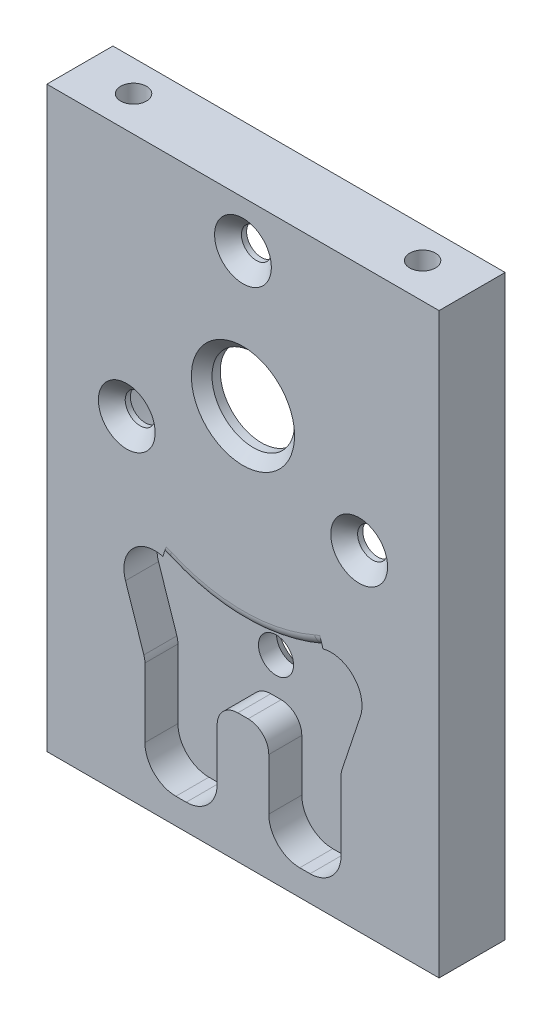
ISO-10303-21;
HEADER;
FILE_DESCRIPTION(('STEP AP214'),'2;1');
FILE_NAME('part.step','',(''),(''),'','','');
FILE_SCHEMA(('AUTOMOTIVE_DESIGN { 1 0 10303 214 1 1 1 1 }'));
ENDSEC;
DATA;
#1=APPLICATION_CONTEXT('core data for automotive mechanical design processes');
#2=APPLICATION_PROTOCOL_DEFINITION('international standard','automotive_design',2000,#1);
#3=PRODUCT_CONTEXT('',#1,'mechanical');
#4=PRODUCT('Part','Part','',(#3));
#5=PRODUCT_RELATED_PRODUCT_CATEGORY('part','',(#4));
#6=PRODUCT_DEFINITION_FORMATION('','',#4);
#7=PRODUCT_DEFINITION_CONTEXT('part definition',#1,'design');
#8=PRODUCT_DEFINITION('design','',#6,#7);
#9=PRODUCT_DEFINITION_SHAPE('','',#8);
#10=(LENGTH_UNIT() NAMED_UNIT(*) SI_UNIT(.MILLI.,.METRE.));
#11=(NAMED_UNIT(*) PLANE_ANGLE_UNIT() SI_UNIT($,.RADIAN.));
#12=(NAMED_UNIT(*) SI_UNIT($,.STERADIAN.) SOLID_ANGLE_UNIT());
#13=UNCERTAINTY_MEASURE_WITH_UNIT(LENGTH_MEASURE(1.E-05),#10,'distance_accuracy_value','');
#14=(GEOMETRIC_REPRESENTATION_CONTEXT(3) GLOBAL_UNCERTAINTY_ASSIGNED_CONTEXT((#13)) GLOBAL_UNIT_ASSIGNED_CONTEXT((#10,
#11,#12)) REPRESENTATION_CONTEXT('',''));
#15=CARTESIAN_POINT('',(0.,0.,0.));
#16=DIRECTION('',(0.,0.,1.));
#17=DIRECTION('',(1.,0.,0.));
#18=AXIS2_PLACEMENT_3D('',#15,#16,#17);
#19=CARTESIAN_POINT('',(0.,38.5,4.6));
#20=DIRECTION('',(0.,0.,-1.));
#21=DIRECTION('',(-1.,0.,0.));
#22=AXIS2_PLACEMENT_3D('',#19,#20,#21);
#23=PLANE('',#22);
#24=CARTESIAN_POINT('',(0.,51.5,4.6));
#25=DIRECTION('',(0.,0.,-1.));
#26=DIRECTION('',(-1.,0.,0.));
#27=AXIS2_PLACEMENT_3D('',#24,#25,#26);
#28=CIRCLE('',#27,1.44999999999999);
#29=CARTESIAN_POINT('',(-1.44999999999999,51.5,4.6));
#30=VERTEX_POINT('',#29);
#31=EDGE_CURVE('E683',#30,#30,#28,.F.);
#32=ORIENTED_EDGE('',*,*,#31,.T.);
#33=EDGE_LOOP('',(#32));
#34=FACE_BOUND('',#33,.T.);
#35=CARTESIAN_POINT('',(11.2583302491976,31.9999999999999,4.6));
#36=DIRECTION('',(0.,0.,-1.));
#37=DIRECTION('',(-1.,0.,0.));
#38=AXIS2_PLACEMENT_3D('',#35,#36,#37);
#39=CIRCLE('',#38,1.44999999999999);
#40=CARTESIAN_POINT('',(9.80833024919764,31.9999999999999,4.6));
#41=VERTEX_POINT('',#40);
#42=EDGE_CURVE('E676',#41,#41,#39,.F.);
#43=ORIENTED_EDGE('',*,*,#42,.T.);
#44=EDGE_LOOP('',(#43));
#45=FACE_BOUND('',#44,.T.);
#46=CARTESIAN_POINT('',(0.,38.5,4.6));
#47=DIRECTION('',(0.,0.,-1.));
#48=DIRECTION('',(-1.,0.,0.));
#49=AXIS2_PLACEMENT_3D('',#46,#47,#48);
#50=CIRCLE('',#49,16.54);
#51=CARTESIAN_POINT('',(-16.54,38.5,4.6));
#52=VERTEX_POINT('',#51);
#53=EDGE_CURVE('E435',#52,#52,#50,.T.);
#54=ORIENTED_EDGE('',*,*,#53,.T.);
#55=EDGE_LOOP('',(#54));
#56=FACE_BOUND('',#55,.T.);
#57=CARTESIAN_POINT('',(0.,38.5,4.6));
#58=DIRECTION('',(0.,0.,-1.));
#59=DIRECTION('',(-1.,0.,0.));
#60=AXIS2_PLACEMENT_3D('',#57,#58,#59);
#61=CIRCLE('',#60,4.00000000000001);
#62=CARTESIAN_POINT('',(-4.00000000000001,38.5,4.6));
#63=VERTEX_POINT('',#62);
#64=EDGE_CURVE('E632',#63,#63,#61,.T.);
#65=ORIENTED_EDGE('',*,*,#64,.F.);
#66=EDGE_LOOP('',(#65));
#67=FACE_BOUND('',#66,.T.);
#68=CARTESIAN_POINT('',(-11.2583302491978,32.,4.6));
#69=DIRECTION('',(0.,0.,-1.));
#70=DIRECTION('',(-1.,0.,0.));
#71=AXIS2_PLACEMENT_3D('',#68,#69,#70);
#72=CIRCLE('',#71,1.44999999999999);
#73=CARTESIAN_POINT('',(-12.7083302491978,32.,4.6));
#74=VERTEX_POINT('',#73);
#75=EDGE_CURVE('E669',#74,#74,#72,.F.);
#76=ORIENTED_EDGE('',*,*,#75,.T.);
#77=EDGE_LOOP('',(#76));
#78=FACE_BOUND('',#77,.T.);
#79=ADVANCED_FACE('F37',(#34,#45,#56,#67,#78),#23,.T.);
#80=CARTESIAN_POINT('',(19.,56.,6.4));
#81=DIRECTION('',(0.,0.,1.));
#82=DIRECTION('',(1.,0.,0.));
#83=AXIS2_PLACEMENT_3D('',#80,#81,#82);
#84=PLANE('',#83);
#85=CARTESIAN_POINT('',(8.53571975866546,19.0939922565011,6.39999999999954));
#86=DIRECTION('',(0.,0.,-1.));
#87=DIRECTION('',(-1.,0.,0.));
#88=AXIS2_PLACEMENT_3D('',#85,#86,#87);
#89=CIRCLE('',#88,4.);
#90=CARTESIAN_POINT('',(7.43981714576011,22.9409387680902,6.39999999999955));
#91=VERTEX_POINT('',#90);
#92=CARTESIAN_POINT('',(6.9252274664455,22.7554557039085,6.39999999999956));
#93=VERTEX_POINT('',#92);
#94=EDGE_CURVE('E258',#91,#93,#89,.F.);
#95=ORIENTED_EDGE('',*,*,#94,.F.);
#96=CARTESIAN_POINT('',(1.74068404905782E-13,20.,6.4));
#97=DIRECTION('',(0.,0.,1.));
#98=DIRECTION('',(1.,0.,0.));
#99=AXIS2_PLACEMENT_3D('',#96,#97,#98);
#100=CIRCLE('',#99,7.9999999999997);
#101=CARTESIAN_POINT('',(7.74881159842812,21.9889491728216,6.39999999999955));
#102=VERTEX_POINT('',#101);
#103=EDGE_CURVE('E11',#102,#91,#100,.T.);
#104=ORIENTED_EDGE('',*,*,#103,.F.);
#105=CARTESIAN_POINT('',(8.53571975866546,19.0939922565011,6.39999999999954));
#106=DIRECTION('',(0.,0.,-1.));
#107=DIRECTION('',(-1.,0.,0.));
#108=AXIS2_PLACEMENT_3D('',#105,#106,#107);
#109=CIRCLE('',#108,3.);
#110=CARTESIAN_POINT('',(11.381769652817,18.1453089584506,6.39999999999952));
#111=VERTEX_POINT('',#110);
#112=EDGE_CURVE('E244',#102,#111,#109,.T.);
#113=ORIENTED_EDGE('',*,*,#112,.T.);
#114=DIRECTION('',(-0.316227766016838,-0.948683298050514,0.));
#115=VECTOR('',#114,1.);
#116=CARTESIAN_POINT('',(11.381769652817,18.1453089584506,6.39999999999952));
#117=LINE('',#116,#115);
#118=CARTESIAN_POINT('',(9.60263340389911,12.8079002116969,6.39999999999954));
#119=VERTEX_POINT('',#118);
#120=EDGE_CURVE('E252',#111,#119,#117,.T.);
#121=ORIENTED_EDGE('',*,*,#120,.T.);
#122=CARTESIAN_POINT('',(11.5000000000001,12.1754446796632,6.39999999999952));
#123=DIRECTION('',(0.,0.,1.));
#124=DIRECTION('',(1.,0.,0.));
#125=AXIS2_PLACEMENT_3D('',#122,#123,#124);
#126=CIRCLE('',#125,2.);
#127=CARTESIAN_POINT('',(9.50000000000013,12.1754446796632,6.39999999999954));
#128=VERTEX_POINT('',#127);
#129=EDGE_CURVE('E483',#119,#128,#126,.T.);
#130=ORIENTED_EDGE('',*,*,#129,.T.);
#131=DIRECTION('',(0.,-1.,0.));
#132=VECTOR('',#131,1.);
#133=CARTESIAN_POINT('',(9.50000000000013,12.1754446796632,6.39999999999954));
#134=LINE('',#133,#132);
#135=CARTESIAN_POINT('',(9.50000000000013,5.49999999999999,6.39999999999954));
#136=VERTEX_POINT('',#135);
#137=EDGE_CURVE('E486',#128,#136,#134,.T.);
#138=ORIENTED_EDGE('',*,*,#137,.T.);
#139=CARTESIAN_POINT('',(6.50000000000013,5.49999999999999,6.39999999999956));
#140=DIRECTION('',(0.,0.,-1.));
#141=DIRECTION('',(1.,0.,0.));
#142=AXIS2_PLACEMENT_3D('',#139,#140,#141);
#143=CIRCLE('',#142,3.);
#144=CARTESIAN_POINT('',(6.50000000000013,2.49999999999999,6.39999999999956));
#145=VERTEX_POINT('',#144);
#146=EDGE_CURVE('E489',#136,#145,#143,.T.);
#147=ORIENTED_EDGE('',*,*,#146,.T.);
#148=DIRECTION('',(-1.,0.,0.));
#149=VECTOR('',#148,1.);
#150=CARTESIAN_POINT('',(5.50000000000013,2.49999999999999,6.39999999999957));
#151=LINE('',#150,#149);
#152=CARTESIAN_POINT('',(5.50000000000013,2.49999999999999,6.39999999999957));
#153=VERTEX_POINT('',#152);
#154=EDGE_CURVE('E492',#145,#153,#151,.T.);
#155=ORIENTED_EDGE('',*,*,#154,.T.);
#156=CARTESIAN_POINT('',(5.50000000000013,5.49999999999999,6.39999999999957));
#157=DIRECTION('',(0.,0.,-1.));
#158=DIRECTION('',(1.,0.,0.));
#159=AXIS2_PLACEMENT_3D('',#156,#157,#158);
#160=CIRCLE('',#159,3.);
#161=CARTESIAN_POINT('',(2.50000000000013,5.49999999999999,6.39999999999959));
#162=VERTEX_POINT('',#161);
#163=EDGE_CURVE('E495',#153,#162,#160,.T.);
#164=ORIENTED_EDGE('',*,*,#163,.T.);
#165=DIRECTION('',(0.,1.,0.));
#166=VECTOR('',#165,1.);
#167=CARTESIAN_POINT('',(2.50000000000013,10.5,6.39999999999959));
#168=LINE('',#167,#166);
#169=CARTESIAN_POINT('',(2.50000000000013,10.5,6.39999999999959));
#170=VERTEX_POINT('',#169);
#171=EDGE_CURVE('E498',#162,#170,#168,.T.);
#172=ORIENTED_EDGE('',*,*,#171,.T.);
#173=CARTESIAN_POINT('',(0.500000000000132,10.5,6.3999999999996));
#174=DIRECTION('',(0.,0.,1.));
#175=DIRECTION('',(-1.,0.,0.));
#176=AXIS2_PLACEMENT_3D('',#173,#174,#175);
#177=CIRCLE('',#176,2.);
#178=CARTESIAN_POINT('',(0.500000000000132,12.5,6.3999999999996));
#179=VERTEX_POINT('',#178);
#180=EDGE_CURVE('E501',#170,#179,#177,.T.);
#181=ORIENTED_EDGE('',*,*,#180,.T.);
#182=DIRECTION('',(-1.,0.,0.));
#183=VECTOR('',#182,1.);
#184=CARTESIAN_POINT('',(-0.499999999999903,12.5,6.39999999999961));
#185=LINE('',#184,#183);
#186=CARTESIAN_POINT('',(-0.499999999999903,12.5,6.39999999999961));
#187=VERTEX_POINT('',#186);
#188=EDGE_CURVE('E503',#179,#187,#185,.T.);
#189=ORIENTED_EDGE('',*,*,#188,.T.);
#190=CARTESIAN_POINT('',(-0.499999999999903,10.5,6.39999999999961));
#191=DIRECTION('',(0.,0.,1.));
#192=DIRECTION('',(1.,0.,0.));
#193=AXIS2_PLACEMENT_3D('',#190,#191,#192);
#194=CIRCLE('',#193,2.);
#195=CARTESIAN_POINT('',(-2.4999999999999,10.5,6.39999999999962));
#196=VERTEX_POINT('',#195);
#197=EDGE_CURVE('E506',#187,#196,#194,.T.);
#198=ORIENTED_EDGE('',*,*,#197,.T.);
#199=DIRECTION('',(0.,-1.,0.));
#200=VECTOR('',#199,1.);
#201=CARTESIAN_POINT('',(-2.4999999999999,10.5,6.39999999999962));
#202=LINE('',#201,#200);
#203=CARTESIAN_POINT('',(-2.4999999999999,5.49999999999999,6.39999999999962));
#204=VERTEX_POINT('',#203);
#205=EDGE_CURVE('E508',#196,#204,#202,.T.);
#206=ORIENTED_EDGE('',*,*,#205,.T.);
#207=CARTESIAN_POINT('',(-5.49999999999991,5.49999999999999,6.39999999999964));
#208=DIRECTION('',(0.,0.,-1.));
#209=DIRECTION('',(1.,0.,0.));
#210=AXIS2_PLACEMENT_3D('',#207,#208,#209);
#211=CIRCLE('',#210,3.);
#212=CARTESIAN_POINT('',(-5.49999999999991,2.49999999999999,6.39999999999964));
#213=VERTEX_POINT('',#212);
#214=EDGE_CURVE('E511',#204,#213,#211,.T.);
#215=ORIENTED_EDGE('',*,*,#214,.T.);
#216=DIRECTION('',(-1.,0.,0.));
#217=VECTOR('',#216,1.);
#218=CARTESIAN_POINT('',(-6.4999999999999,2.49999999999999,6.39999999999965));
#219=LINE('',#218,#217);
#220=CARTESIAN_POINT('',(-6.4999999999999,2.49999999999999,6.39999999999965));
#221=VERTEX_POINT('',#220);
#222=EDGE_CURVE('E514',#213,#221,#219,.T.);
#223=ORIENTED_EDGE('',*,*,#222,.T.);
#224=CARTESIAN_POINT('',(-6.4999999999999,5.49999999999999,6.39999999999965));
#225=DIRECTION('',(0.,0.,-1.));
#226=DIRECTION('',(1.,0.,0.));
#227=AXIS2_PLACEMENT_3D('',#224,#225,#226);
#228=CIRCLE('',#227,3.);
#229=CARTESIAN_POINT('',(-9.4999999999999,5.49999999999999,6.39999999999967));
#230=VERTEX_POINT('',#229);
#231=EDGE_CURVE('E517',#221,#230,#228,.T.);
#232=ORIENTED_EDGE('',*,*,#231,.T.);
#233=DIRECTION('',(0.,1.,0.));
#234=VECTOR('',#233,1.);
#235=CARTESIAN_POINT('',(-9.4999999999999,12.1754446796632,6.39999999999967));
#236=LINE('',#235,#234);
#237=CARTESIAN_POINT('',(-9.4999999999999,12.1754446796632,6.39999999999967));
#238=VERTEX_POINT('',#237);
#239=EDGE_CURVE('E520',#230,#238,#236,.T.);
#240=ORIENTED_EDGE('',*,*,#239,.T.);
#241=CARTESIAN_POINT('',(-11.4999999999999,12.1754446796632,6.39999999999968));
#242=DIRECTION('',(0.,0.,1.));
#243=DIRECTION('',(-1.,0.,0.));
#244=AXIS2_PLACEMENT_3D('',#241,#242,#243);
#245=CIRCLE('',#244,2.);
#246=CARTESIAN_POINT('',(-9.60263340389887,12.8079002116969,6.39999999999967));
#247=VERTEX_POINT('',#246);
#248=EDGE_CURVE('E523',#238,#247,#245,.T.);
#249=ORIENTED_EDGE('',*,*,#248,.T.);
#250=DIRECTION('',(-0.316227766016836,0.948683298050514,0.));
#251=VECTOR('',#250,1.);
#252=CARTESIAN_POINT('',(-11.3817696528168,18.1453089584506,6.39999999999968));
#253=LINE('',#252,#251);
#254=CARTESIAN_POINT('',(-11.3817696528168,18.1453089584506,6.39999999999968));
#255=VERTEX_POINT('',#254);
#256=EDGE_CURVE('E474',#247,#255,#253,.T.);
#257=ORIENTED_EDGE('',*,*,#256,.T.);
#258=CARTESIAN_POINT('',(-8.53571975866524,19.0939922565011,6.39999999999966));
#259=DIRECTION('',(0.,0.,-1.));
#260=DIRECTION('',(-1.,0.,0.));
#261=AXIS2_PLACEMENT_3D('',#258,#259,#260);
#262=CIRCLE('',#261,3.);
#263=CARTESIAN_POINT('',(-7.74881159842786,21.9889491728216,6.39999999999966));
#264=VERTEX_POINT('',#263);
#265=EDGE_CURVE('E253',#255,#264,#262,.T.);
#266=ORIENTED_EDGE('',*,*,#265,.T.);
#267=CARTESIAN_POINT('',(-7.43981714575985,22.9409387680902,6.39999999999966));
#268=VERTEX_POINT('',#267);
#269=EDGE_CURVE('E46',#268,#264,#100,.T.);
#270=ORIENTED_EDGE('',*,*,#269,.F.);
#271=CARTESIAN_POINT('',(-8.53571975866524,19.0939922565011,6.39999999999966));
#272=DIRECTION('',(0.,0.,-1.));
#273=DIRECTION('',(-1.,0.,0.));
#274=AXIS2_PLACEMENT_3D('',#271,#272,#273);
#275=CIRCLE('',#274,4.);
#276=CARTESIAN_POINT('',(-6.92522746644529,22.7554557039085,6.39999999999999));
#277=VERTEX_POINT('',#276);
#278=EDGE_CURVE('E241',#277,#268,#275,.F.);
#279=ORIENTED_EDGE('',*,*,#278,.F.);
#280=CARTESIAN_POINT('',(1.31838984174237E-13,38.5,6.3999999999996));
#281=DIRECTION('',(0.,0.,-1.));
#282=DIRECTION('',(-1.,0.,0.));
#283=AXIS2_PLACEMENT_3D('',#280,#281,#282);
#284=CIRCLE('',#283,17.2002747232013);
#285=EDGE_CURVE('E260',#93,#277,#284,.T.);
#286=ORIENTED_EDGE('',*,*,#285,.F.);
#287=EDGE_LOOP('',(#95,#104,#113,#121,#130,#138,#147,#155,#164,#172,#181,#189,#198,#206,#215,
#223,#232,#240,#249,#257,#266,#270,#279,#286));
#288=FACE_BOUND('',#287,.T.);
#289=DIRECTION('',(0.,1.,0.));
#290=VECTOR('',#289,1.);
#291=CARTESIAN_POINT('',(19.,0.,6.4));
#292=LINE('',#291,#290);
#293=CARTESIAN_POINT('',(19.,0.,6.4));
#294=VERTEX_POINT('',#293);
#295=CARTESIAN_POINT('',(19.,56.,6.4));
#296=VERTEX_POINT('',#295);
#297=EDGE_CURVE('E447',#294,#296,#292,.T.);
#298=ORIENTED_EDGE('',*,*,#297,.T.);
#299=DIRECTION('',(-1.,0.,0.));
#300=VECTOR('',#299,1.);
#301=CARTESIAN_POINT('',(19.,56.,6.4));
#302=LINE('',#301,#300);
#303=CARTESIAN_POINT('',(-19.,56.,6.4));
#304=VERTEX_POINT('',#303);
#305=EDGE_CURVE('E91',#296,#304,#302,.T.);
#306=ORIENTED_EDGE('',*,*,#305,.T.);
#307=DIRECTION('',(0.,-1.,0.));
#308=VECTOR('',#307,1.);
#309=CARTESIAN_POINT('',(-19.,56.,6.4));
#310=LINE('',#309,#308);
#311=CARTESIAN_POINT('',(-19.,0.,6.4));
#312=VERTEX_POINT('',#311);
#313=EDGE_CURVE('E639',#304,#312,#310,.T.);
#314=ORIENTED_EDGE('',*,*,#313,.T.);
#315=DIRECTION('',(1.,0.,0.));
#316=VECTOR('',#315,1.);
#317=CARTESIAN_POINT('',(-19.,0.,6.4));
#318=LINE('',#317,#316);
#319=EDGE_CURVE('E62',#312,#294,#318,.T.);
#320=ORIENTED_EDGE('',*,*,#319,.T.);
#321=EDGE_LOOP('',(#298,#306,#314,#320));
#322=FACE_BOUND('',#321,.T.);
#323=CARTESIAN_POINT('',(-11.2583302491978,32.,6.4));
#324=DIRECTION('',(0.,0.,1.));
#325=DIRECTION('',(1.,0.,0.));
#326=AXIS2_PLACEMENT_3D('',#323,#324,#325);
#327=CIRCLE('',#326,2.75);
#328=CARTESIAN_POINT('',(-8.50833024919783,32.,6.4));
#329=VERTEX_POINT('',#328);
#330=EDGE_CURVE('E647',#329,#329,#327,.T.);
#331=ORIENTED_EDGE('',*,*,#330,.F.);
#332=EDGE_LOOP('',(#331));
#333=FACE_BOUND('',#332,.T.);
#334=CARTESIAN_POINT('',(11.2583302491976,31.9999999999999,6.4));
#335=DIRECTION('',(0.,0.,1.));
#336=DIRECTION('',(1.,0.,0.));
#337=AXIS2_PLACEMENT_3D('',#334,#335,#336);
#338=CIRCLE('',#337,2.75);
#339=CARTESIAN_POINT('',(14.0083302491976,31.9999999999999,6.4));
#340=VERTEX_POINT('',#339);
#341=EDGE_CURVE('E651',#340,#340,#338,.T.);
#342=ORIENTED_EDGE('',*,*,#341,.F.);
#343=EDGE_LOOP('',(#342));
#344=FACE_BOUND('',#343,.T.);
#345=CARTESIAN_POINT('',(0.,51.5,6.4));
#346=DIRECTION('',(0.,0.,1.));
#347=DIRECTION('',(1.,0.,0.));
#348=AXIS2_PLACEMENT_3D('',#345,#346,#347);
#349=CIRCLE('',#348,2.75);
#350=CARTESIAN_POINT('',(2.75,51.5,6.4));
#351=VERTEX_POINT('',#350);
#352=EDGE_CURVE('E655',#351,#351,#349,.T.);
#353=ORIENTED_EDGE('',*,*,#352,.F.);
#354=EDGE_LOOP('',(#353));
#355=FACE_BOUND('',#354,.T.);
#356=CARTESIAN_POINT('',(0.,38.5,6.4));
#357=DIRECTION('',(0.,0.,1.));
#358=DIRECTION('',(1.,0.,0.));
#359=AXIS2_PLACEMENT_3D('',#356,#357,#358);
#360=CIRCLE('',#359,5.00000000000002);
#361=CARTESIAN_POINT('',(5.00000000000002,38.5,6.4));
#362=VERTEX_POINT('',#361);
#363=EDGE_CURVE('E455',#362,#362,#360,.F.);
#364=ORIENTED_EDGE('',*,*,#363,.T.);
#365=EDGE_LOOP('',(#364));
#366=FACE_BOUND('',#365,.T.);
#367=ADVANCED_FACE('F256',(#288,#322,#333,#344,#355,#366),#84,.T.);
#368=CARTESIAN_POINT('',(19.,56.,0.));
#369=DIRECTION('',(0.,0.,1.));
#370=DIRECTION('',(1.,0.,0.));
#371=AXIS2_PLACEMENT_3D('',#368,#369,#370);
#372=PLANE('',#371);
#373=CARTESIAN_POINT('',(0.,16.,0.));
#374=DIRECTION('',(0.,0.,-1.));
#375=DIRECTION('',(-1.,0.,0.));
#376=AXIS2_PLACEMENT_3D('',#373,#374,#375);
#377=CIRCLE('',#376,3.15);
#378=CARTESIAN_POINT('',(-3.15,16.,0.));
#379=VERTEX_POINT('',#378);
#380=EDGE_CURVE('E624',#379,#379,#377,.T.);
#381=ORIENTED_EDGE('',*,*,#380,.F.);
#382=EDGE_LOOP('',(#381));
#383=FACE_BOUND('',#382,.T.);
#384=DIRECTION('',(0.,1.,0.));
#385=VECTOR('',#384,1.);
#386=CARTESIAN_POINT('',(19.,0.,0.));
#387=LINE('',#386,#385);
#388=CARTESIAN_POINT('',(19.,0.,0.));
#389=VERTEX_POINT('',#388);
#390=CARTESIAN_POINT('',(19.,56.,0.));
#391=VERTEX_POINT('',#390);
#392=EDGE_CURVE('E429',#389,#391,#387,.T.);
#393=ORIENTED_EDGE('',*,*,#392,.F.);
#394=DIRECTION('',(1.,0.,0.));
#395=VECTOR('',#394,1.);
#396=CARTESIAN_POINT('',(-19.,0.,0.));
#397=LINE('',#396,#395);
#398=CARTESIAN_POINT('',(-19.,0.,0.));
#399=VERTEX_POINT('',#398);
#400=EDGE_CURVE('E83',#399,#389,#397,.T.);
#401=ORIENTED_EDGE('',*,*,#400,.F.);
#402=DIRECTION('',(0.,-1.,0.));
#403=VECTOR('',#402,1.);
#404=CARTESIAN_POINT('',(-19.,56.,0.));
#405=LINE('',#404,#403);
#406=CARTESIAN_POINT('',(-19.,56.,0.));
#407=VERTEX_POINT('',#406);
#408=EDGE_CURVE('E437',#407,#399,#405,.T.);
#409=ORIENTED_EDGE('',*,*,#408,.F.);
#410=DIRECTION('',(-1.,0.,0.));
#411=VECTOR('',#410,1.);
#412=CARTESIAN_POINT('',(19.,56.,0.));
#413=LINE('',#412,#411);
#414=EDGE_CURVE('E434',#391,#407,#413,.T.);
#415=ORIENTED_EDGE('',*,*,#414,.F.);
#416=EDGE_LOOP('',(#393,#401,#409,#415));
#417=FACE_BOUND('',#416,.T.);
#418=CARTESIAN_POINT('',(0.,38.5,0.));
#419=DIRECTION('',(0.,0.,-1.));
#420=DIRECTION('',(-1.,0.,0.));
#421=AXIS2_PLACEMENT_3D('',#418,#419,#420);
#422=CIRCLE('',#421,16.54);
#423=CARTESIAN_POINT('',(-16.54,38.5,0.));
#424=VERTEX_POINT('',#423);
#425=EDGE_CURVE('E440',#424,#424,#422,.T.);
#426=ORIENTED_EDGE('',*,*,#425,.F.);
#427=EDGE_LOOP('',(#426));
#428=FACE_BOUND('',#427,.T.);
#429=ADVANCED_FACE('F407',(#383,#417,#428),#372,.F.);
#430=CARTESIAN_POINT('',(19.,0.,6.4));
#431=DIRECTION('',(-1.,0.,0.));
#432=DIRECTION('',(0.,0.,1.));
#433=AXIS2_PLACEMENT_3D('',#430,#431,#432);
#434=PLANE('',#433);
#435=ORIENTED_EDGE('',*,*,#392,.T.);
#436=DIRECTION('',(0.,0.,-1.));
#437=VECTOR('',#436,1.);
#438=CARTESIAN_POINT('',(19.,56.,6.4));
#439=LINE('',#438,#437);
#440=EDGE_CURVE('E431',#296,#391,#439,.T.);
#441=ORIENTED_EDGE('',*,*,#440,.F.);
#442=ORIENTED_EDGE('',*,*,#297,.F.);
#443=DIRECTION('',(0.,0.,-1.));
#444=VECTOR('',#443,1.);
#445=CARTESIAN_POINT('',(19.,0.,6.4));
#446=LINE('',#445,#444);
#447=EDGE_CURVE('E432',#294,#389,#446,.T.);
#448=ORIENTED_EDGE('',*,*,#447,.T.);
#449=EDGE_LOOP('',(#435,#441,#442,#448));
#450=FACE_BOUND('',#449,.T.);
#451=ADVANCED_FACE('F410',(#450),#434,.F.);
#452=CARTESIAN_POINT('',(19.,56.,6.4));
#453=DIRECTION('',(0.,-1.,0.));
#454=DIRECTION('',(1.,0.,0.));
#455=AXIS2_PLACEMENT_3D('',#452,#453,#454);
#456=PLANE('',#455);
#457=CARTESIAN_POINT('',(-14.,56.,3.));
#458=DIRECTION('',(0.,1.,0.));
#459=DIRECTION('',(-1.,0.,0.));
#460=AXIS2_PLACEMENT_3D('',#457,#458,#459);
#461=CIRCLE('',#460,1.25);
#462=CARTESIAN_POINT('',(-15.25,56.,3.));
#463=VERTEX_POINT('',#462);
#464=EDGE_CURVE('E697',#463,#463,#461,.T.);
#465=ORIENTED_EDGE('',*,*,#464,.F.);
#466=EDGE_LOOP('',(#465));
#467=FACE_BOUND('',#466,.T.);
#468=CARTESIAN_POINT('',(14.,56.,3.));
#469=DIRECTION('',(0.,1.,0.));
#470=DIRECTION('',(1.,0.,0.));
#471=AXIS2_PLACEMENT_3D('',#468,#469,#470);
#472=CIRCLE('',#471,1.25);
#473=CARTESIAN_POINT('',(15.25,56.,3.));
#474=VERTEX_POINT('',#473);
#475=EDGE_CURVE('E690',#474,#474,#472,.T.);
#476=ORIENTED_EDGE('',*,*,#475,.F.);
#477=EDGE_LOOP('',(#476));
#478=FACE_BOUND('',#477,.T.);
#479=ORIENTED_EDGE('',*,*,#414,.T.);
#480=DIRECTION('',(0.,0.,-1.));
#481=VECTOR('',#480,1.);
#482=CARTESIAN_POINT('',(-19.,56.,6.4));
#483=LINE('',#482,#481);
#484=EDGE_CURVE('E451',#304,#407,#483,.T.);
#485=ORIENTED_EDGE('',*,*,#484,.F.);
#486=ORIENTED_EDGE('',*,*,#305,.F.);
#487=ORIENTED_EDGE('',*,*,#440,.T.);
#488=EDGE_LOOP('',(#479,#485,#486,#487));
#489=FACE_BOUND('',#488,.T.);
#490=ADVANCED_FACE('F418',(#467,#478,#489),#456,.F.);
#491=CARTESIAN_POINT('',(-19.,56.,6.4));
#492=DIRECTION('',(1.,0.,0.));
#493=DIRECTION('',(0.,0.,-1.));
#494=AXIS2_PLACEMENT_3D('',#491,#492,#493);
#495=PLANE('',#494);
#496=ORIENTED_EDGE('',*,*,#408,.T.);
#497=DIRECTION('',(0.,0.,-1.));
#498=VECTOR('',#497,1.);
#499=CARTESIAN_POINT('',(-19.,0.,6.4));
#500=LINE('',#499,#498);
#501=EDGE_CURVE('E449',#312,#399,#500,.T.);
#502=ORIENTED_EDGE('',*,*,#501,.F.);
#503=ORIENTED_EDGE('',*,*,#313,.F.);
#504=ORIENTED_EDGE('',*,*,#484,.T.);
#505=EDGE_LOOP('',(#496,#502,#503,#504));
#506=FACE_BOUND('',#505,.T.);
#507=ADVANCED_FACE('F414',(#506),#495,.F.);
#508=CARTESIAN_POINT('',(-19.,0.,6.4));
#509=DIRECTION('',(0.,1.,0.));
#510=DIRECTION('',(0.,0.,1.));
#511=AXIS2_PLACEMENT_3D('',#508,#509,#510);
#512=PLANE('',#511);
#513=CARTESIAN_POINT('',(12.,0.,3.));
#514=DIRECTION('',(0.,-1.,0.));
#515=DIRECTION('',(0.,0.,-1.));
#516=AXIS2_PLACEMENT_3D('',#513,#514,#515);
#517=CIRCLE('',#516,1.25);
#518=CARTESIAN_POINT('',(12.,0.,1.75));
#519=VERTEX_POINT('',#518);
#520=EDGE_CURVE('E714',#519,#519,#517,.T.);
#521=ORIENTED_EDGE('',*,*,#520,.F.);
#522=EDGE_LOOP('',(#521));
#523=FACE_BOUND('',#522,.T.);
#524=CARTESIAN_POINT('',(0.,0.,3.));
#525=DIRECTION('',(0.,-1.,0.));
#526=DIRECTION('',(0.,0.,-1.));
#527=AXIS2_PLACEMENT_3D('',#524,#525,#526);
#528=CIRCLE('',#527,1.25);
#529=CARTESIAN_POINT('',(0.,0.,1.75));
#530=VERTEX_POINT('',#529);
#531=EDGE_CURVE('E708',#530,#530,#528,.T.);
#532=ORIENTED_EDGE('',*,*,#531,.F.);
#533=EDGE_LOOP('',(#532));
#534=FACE_BOUND('',#533,.T.);
#535=CARTESIAN_POINT('',(-12.,0.,3.));
#536=DIRECTION('',(0.,-1.,0.));
#537=DIRECTION('',(0.,0.,1.));
#538=AXIS2_PLACEMENT_3D('',#535,#536,#537);
#539=CIRCLE('',#538,1.25);
#540=CARTESIAN_POINT('',(-12.,0.,4.25));
#541=VERTEX_POINT('',#540);
#542=EDGE_CURVE('E702',#541,#541,#539,.T.);
#543=ORIENTED_EDGE('',*,*,#542,.F.);
#544=EDGE_LOOP('',(#543));
#545=FACE_BOUND('',#544,.T.);
#546=ORIENTED_EDGE('',*,*,#400,.T.);
#547=ORIENTED_EDGE('',*,*,#447,.F.);
#548=ORIENTED_EDGE('',*,*,#319,.F.);
#549=ORIENTED_EDGE('',*,*,#501,.T.);
#550=EDGE_LOOP('',(#546,#547,#548,#549));
#551=FACE_BOUND('',#550,.T.);
#552=ADVANCED_FACE('F403',(#523,#534,#545,#551),#512,.F.);
#553=CARTESIAN_POINT('',(0.,38.5,4.6));
#554=DIRECTION('',(0.,0.,-1.));
#555=DIRECTION('',(-1.,0.,0.));
#556=AXIS2_PLACEMENT_3D('',#553,#554,#555);
#557=CYLINDRICAL_SURFACE('',#556,16.54);
#558=ORIENTED_EDGE('',*,*,#425,.T.);
#559=EDGE_LOOP('',(#558));
#560=FACE_BOUND('',#559,.T.);
#561=ORIENTED_EDGE('',*,*,#53,.F.);
#562=EDGE_LOOP('',(#561));
#563=FACE_BOUND('',#562,.T.);
#564=ADVANCED_FACE('F396',(#560,#563),#557,.F.);
#565=CARTESIAN_POINT('',(0.,38.5,6.4));
#566=DIRECTION('',(0.,0.,-1.));
#567=DIRECTION('',(-1.,0.,0.));
#568=AXIS2_PLACEMENT_3D('',#565,#566,#567);
#569=CYLINDRICAL_SURFACE('',#568,4.00000000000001);
#570=CARTESIAN_POINT('',(0.,38.5,5.39999999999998));
#571=DIRECTION('',(0.,0.,1.));
#572=DIRECTION('',(1.,0.,0.));
#573=AXIS2_PLACEMENT_3D('',#570,#571,#572);
#574=CIRCLE('',#573,4.00000000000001);
#575=CARTESIAN_POINT('',(4.00000000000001,38.5,5.39999999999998));
#576=VERTEX_POINT('',#575);
#577=EDGE_CURVE('E458',#576,#576,#574,.T.);
#578=ORIENTED_EDGE('',*,*,#577,.T.);
#579=EDGE_LOOP('',(#578));
#580=FACE_BOUND('',#579,.T.);
#581=ORIENTED_EDGE('',*,*,#64,.T.);
#582=EDGE_LOOP('',(#581));
#583=FACE_BOUND('',#582,.T.);
#584=ADVANCED_FACE('F389',(#580,#583),#569,.F.);
#585=CARTESIAN_POINT('',(-11.2583302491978,32.,6.4));
#586=DIRECTION('',(0.,0.,1.));
#587=DIRECTION('',(1.,0.,0.));
#588=AXIS2_PLACEMENT_3D('',#585,#586,#587);
#589=CYLINDRICAL_SURFACE('',#588,1.44999999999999);
#590=ORIENTED_EDGE('',*,*,#75,.F.);
#591=EDGE_LOOP('',(#590));
#592=FACE_BOUND('',#591,.T.);
#593=CARTESIAN_POINT('',(-11.2583302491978,32.,5.09999999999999));
#594=DIRECTION('',(0.,0.,1.));
#595=DIRECTION('',(1.,0.,0.));
#596=AXIS2_PLACEMENT_3D('',#593,#594,#595);
#597=CIRCLE('',#596,1.44999999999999);
#598=CARTESIAN_POINT('',(-9.80833024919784,32.,5.09999999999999));
#599=VERTEX_POINT('',#598);
#600=EDGE_CURVE('E635',#599,#599,#597,.T.);
#601=ORIENTED_EDGE('',*,*,#600,.T.);
#602=EDGE_LOOP('',(#601));
#603=FACE_BOUND('',#602,.T.);
#604=ADVANCED_FACE('F386',(#592,#603),#589,.F.);
#605=CARTESIAN_POINT('',(-11.2583302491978,32.,6.4));
#606=DIRECTION('',(0.,0.,1.));
#607=DIRECTION('',(1.,0.,0.));
#608=AXIS2_PLACEMENT_3D('',#605,#606,#607);
#609=CONICAL_SURFACE('',#608,2.75,0.785398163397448);
#610=ORIENTED_EDGE('',*,*,#600,.F.);
#611=EDGE_LOOP('',(#610));
#612=FACE_BOUND('',#611,.T.);
#613=ORIENTED_EDGE('',*,*,#330,.T.);
#614=EDGE_LOOP('',(#613));
#615=FACE_BOUND('',#614,.T.);
#616=ADVANCED_FACE('F381',(#612,#615),#609,.F.);
#617=CARTESIAN_POINT('',(11.2583302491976,31.9999999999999,6.4));
#618=DIRECTION('',(0.,0.,1.));
#619=DIRECTION('',(1.,0.,0.));
#620=AXIS2_PLACEMENT_3D('',#617,#618,#619);
#621=CYLINDRICAL_SURFACE('',#620,1.44999999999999);
#622=ORIENTED_EDGE('',*,*,#42,.F.);
#623=EDGE_LOOP('',(#622));
#624=FACE_BOUND('',#623,.T.);
#625=CARTESIAN_POINT('',(11.2583302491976,31.9999999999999,5.09999999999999));
#626=DIRECTION('',(0.,0.,1.));
#627=DIRECTION('',(1.,0.,0.));
#628=AXIS2_PLACEMENT_3D('',#625,#626,#627);
#629=CIRCLE('',#628,1.44999999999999);
#630=CARTESIAN_POINT('',(12.7083302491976,31.9999999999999,5.09999999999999));
#631=VERTEX_POINT('',#630);
#632=EDGE_CURVE('E673',#631,#631,#629,.T.);
#633=ORIENTED_EDGE('',*,*,#632,.T.);
#634=EDGE_LOOP('',(#633));
#635=FACE_BOUND('',#634,.T.);
#636=ADVANCED_FACE('F378',(#624,#635),#621,.F.);
#637=CARTESIAN_POINT('',(11.2583302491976,31.9999999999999,6.4));
#638=DIRECTION('',(0.,0.,1.));
#639=DIRECTION('',(1.,0.,0.));
#640=AXIS2_PLACEMENT_3D('',#637,#638,#639);
#641=CONICAL_SURFACE('',#640,2.75,0.785398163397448);
#642=ORIENTED_EDGE('',*,*,#632,.F.);
#643=EDGE_LOOP('',(#642));
#644=FACE_BOUND('',#643,.T.);
#645=ORIENTED_EDGE('',*,*,#341,.T.);
#646=EDGE_LOOP('',(#645));
#647=FACE_BOUND('',#646,.T.);
#648=ADVANCED_FACE('F373',(#644,#647),#641,.F.);
#649=CARTESIAN_POINT('',(0.,51.5,6.4));
#650=DIRECTION('',(0.,0.,1.));
#651=DIRECTION('',(1.,0.,0.));
#652=AXIS2_PLACEMENT_3D('',#649,#650,#651);
#653=CYLINDRICAL_SURFACE('',#652,1.44999999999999);
#654=ORIENTED_EDGE('',*,*,#31,.F.);
#655=EDGE_LOOP('',(#654));
#656=FACE_BOUND('',#655,.T.);
#657=CARTESIAN_POINT('',(0.,51.5,5.09999999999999));
#658=DIRECTION('',(0.,0.,1.));
#659=DIRECTION('',(1.,0.,0.));
#660=AXIS2_PLACEMENT_3D('',#657,#658,#659);
#661=CIRCLE('',#660,1.44999999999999);
#662=CARTESIAN_POINT('',(1.44999999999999,51.5,5.09999999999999));
#663=VERTEX_POINT('',#662);
#664=EDGE_CURVE('E680',#663,#663,#661,.T.);
#665=ORIENTED_EDGE('',*,*,#664,.T.);
#666=EDGE_LOOP('',(#665));
#667=FACE_BOUND('',#666,.T.);
#668=ADVANCED_FACE('F369',(#656,#667),#653,.F.);
#669=CARTESIAN_POINT('',(0.,51.5,6.4));
#670=DIRECTION('',(0.,0.,1.));
#671=DIRECTION('',(1.,0.,0.));
#672=AXIS2_PLACEMENT_3D('',#669,#670,#671);
#673=CONICAL_SURFACE('',#672,2.75,0.785398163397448);
#674=ORIENTED_EDGE('',*,*,#664,.F.);
#675=EDGE_LOOP('',(#674));
#676=FACE_BOUND('',#675,.T.);
#677=ORIENTED_EDGE('',*,*,#352,.T.);
#678=EDGE_LOOP('',(#677));
#679=FACE_BOUND('',#678,.T.);
#680=ADVANCED_FACE('F372',(#676,#679),#673,.F.);
#681=CARTESIAN_POINT('',(0.,38.5,6.4));
#682=DIRECTION('',(0.,0.,1.));
#683=DIRECTION('',(1.,0.,0.));
#684=AXIS2_PLACEMENT_3D('',#681,#682,#683);
#685=CONICAL_SURFACE('',#684,5.00000000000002,0.785398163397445);
#686=ORIENTED_EDGE('',*,*,#577,.F.);
#687=EDGE_LOOP('',(#686));
#688=FACE_BOUND('',#687,.T.);
#689=ORIENTED_EDGE('',*,*,#363,.F.);
#690=EDGE_LOOP('',(#689));
#691=FACE_BOUND('',#690,.T.);
#692=ADVANCED_FACE('F39',(#688,#691),#685,.F.);
#693=CARTESIAN_POINT('',(14.,50.,3.));
#694=DIRECTION('',(0.,1.,0.));
#695=DIRECTION('',(-1.,0.,0.));
#696=AXIS2_PLACEMENT_3D('',#693,#694,#695);
#697=CYLINDRICAL_SURFACE('',#696,1.25);
#698=CARTESIAN_POINT('',(14.,50.,3.));
#699=DIRECTION('',(0.,1.,0.));
#700=DIRECTION('',(1.,0.,0.));
#701=AXIS2_PLACEMENT_3D('',#698,#699,#700);
#702=CIRCLE('',#701,1.25);
#703=CARTESIAN_POINT('',(15.25,50.,3.));
#704=VERTEX_POINT('',#703);
#705=EDGE_CURVE('E693',#704,#704,#702,.T.);
#706=ORIENTED_EDGE('',*,*,#705,.F.);
#707=EDGE_LOOP('',(#706));
#708=FACE_BOUND('',#707,.T.);
#709=ORIENTED_EDGE('',*,*,#475,.T.);
#710=EDGE_LOOP('',(#709));
#711=FACE_BOUND('',#710,.T.);
#712=ADVANCED_FACE('F364',(#708,#711),#697,.F.);
#713=CARTESIAN_POINT('',(14.,50.,3.));
#714=DIRECTION('',(0.,-1.,0.));
#715=DIRECTION('',(1.,0.,0.));
#716=AXIS2_PLACEMENT_3D('',#713,#714,#715);
#717=PLANE('',#716);
#718=ORIENTED_EDGE('',*,*,#705,.T.);
#719=EDGE_LOOP('',(#718));
#720=FACE_BOUND('',#719,.T.);
#721=ADVANCED_FACE('F360',(#720),#717,.F.);
#722=CARTESIAN_POINT('',(-14.,50.,3.));
#723=DIRECTION('',(0.,1.,0.));
#724=DIRECTION('',(-1.,0.,0.));
#725=AXIS2_PLACEMENT_3D('',#722,#723,#724);
#726=CYLINDRICAL_SURFACE('',#725,1.25);
#727=CARTESIAN_POINT('',(-14.,50.,3.));
#728=DIRECTION('',(0.,1.,0.));
#729=DIRECTION('',(-1.,0.,0.));
#730=AXIS2_PLACEMENT_3D('',#727,#728,#729);
#731=CIRCLE('',#730,1.25);
#732=CARTESIAN_POINT('',(-15.25,50.,3.));
#733=VERTEX_POINT('',#732);
#734=EDGE_CURVE('E687',#733,#733,#731,.T.);
#735=ORIENTED_EDGE('',*,*,#734,.F.);
#736=EDGE_LOOP('',(#735));
#737=FACE_BOUND('',#736,.T.);
#738=ORIENTED_EDGE('',*,*,#464,.T.);
#739=EDGE_LOOP('',(#738));
#740=FACE_BOUND('',#739,.T.);
#741=ADVANCED_FACE('F356',(#737,#740),#726,.F.);
#742=CARTESIAN_POINT('',(-14.,50.,3.));
#743=DIRECTION('',(0.,1.,0.));
#744=DIRECTION('',(-1.,0.,0.));
#745=AXIS2_PLACEMENT_3D('',#742,#743,#744);
#746=PLANE('',#745);
#747=ORIENTED_EDGE('',*,*,#734,.T.);
#748=EDGE_LOOP('',(#747));
#749=FACE_BOUND('',#748,.T.);
#750=ADVANCED_FACE('F352',(#749),#746,.T.);
#751=CARTESIAN_POINT('',(-12.,10.,3.));
#752=DIRECTION('',(0.,-1.,0.));
#753=DIRECTION('',(0.,0.,-1.));
#754=AXIS2_PLACEMENT_3D('',#751,#752,#753);
#755=CYLINDRICAL_SURFACE('',#754,1.25);
#756=CARTESIAN_POINT('',(-12.,10.,3.));
#757=DIRECTION('',(0.,-1.,0.));
#758=DIRECTION('',(0.,0.,1.));
#759=AXIS2_PLACEMENT_3D('',#756,#757,#758);
#760=CIRCLE('',#759,1.25);
#761=CARTESIAN_POINT('',(-12.,10.,4.25));
#762=VERTEX_POINT('',#761);
#763=EDGE_CURVE('E705',#762,#762,#760,.T.);
#764=ORIENTED_EDGE('',*,*,#763,.F.);
#765=EDGE_LOOP('',(#764));
#766=FACE_BOUND('',#765,.T.);
#767=ORIENTED_EDGE('',*,*,#542,.T.);
#768=EDGE_LOOP('',(#767));
#769=FACE_BOUND('',#768,.T.);
#770=ADVANCED_FACE('F348',(#766,#769),#755,.F.);
#771=CARTESIAN_POINT('',(-12.,10.,3.));
#772=DIRECTION('',(0.,1.,0.));
#773=DIRECTION('',(0.,0.,1.));
#774=AXIS2_PLACEMENT_3D('',#771,#772,#773);
#775=PLANE('',#774);
#776=ORIENTED_EDGE('',*,*,#763,.T.);
#777=EDGE_LOOP('',(#776));
#778=FACE_BOUND('',#777,.T.);
#779=ADVANCED_FACE('F344',(#778),#775,.F.);
#780=CARTESIAN_POINT('',(0.,10.,3.));
#781=DIRECTION('',(0.,-1.,0.));
#782=DIRECTION('',(0.,0.,-1.));
#783=AXIS2_PLACEMENT_3D('',#780,#781,#782);
#784=CYLINDRICAL_SURFACE('',#783,1.25);
#785=CARTESIAN_POINT('',(0.,10.,3.));
#786=DIRECTION('',(0.,-1.,0.));
#787=DIRECTION('',(0.,0.,-1.));
#788=AXIS2_PLACEMENT_3D('',#785,#786,#787);
#789=CIRCLE('',#788,1.25);
#790=CARTESIAN_POINT('',(0.,10.,1.75));
#791=VERTEX_POINT('',#790);
#792=EDGE_CURVE('E711',#791,#791,#789,.T.);
#793=ORIENTED_EDGE('',*,*,#792,.F.);
#794=EDGE_LOOP('',(#793));
#795=FACE_BOUND('',#794,.T.);
#796=ORIENTED_EDGE('',*,*,#531,.T.);
#797=EDGE_LOOP('',(#796));
#798=FACE_BOUND('',#797,.T.);
#799=ADVANCED_FACE('F340',(#795,#798),#784,.F.);
#800=CARTESIAN_POINT('',(0.,10.,3.));
#801=DIRECTION('',(0.,-1.,0.));
#802=DIRECTION('',(0.,0.,-1.));
#803=AXIS2_PLACEMENT_3D('',#800,#801,#802);
#804=PLANE('',#803);
#805=ORIENTED_EDGE('',*,*,#792,.T.);
#806=EDGE_LOOP('',(#805));
#807=FACE_BOUND('',#806,.T.);
#808=ADVANCED_FACE('F336',(#807),#804,.T.);
#809=CARTESIAN_POINT('',(12.,10.,3.));
#810=DIRECTION('',(0.,-1.,0.));
#811=DIRECTION('',(0.,0.,-1.));
#812=AXIS2_PLACEMENT_3D('',#809,#810,#811);
#813=CYLINDRICAL_SURFACE('',#812,1.25);
#814=CARTESIAN_POINT('',(12.,10.,3.));
#815=DIRECTION('',(0.,-1.,0.));
#816=DIRECTION('',(0.,0.,-1.));
#817=AXIS2_PLACEMENT_3D('',#814,#815,#816);
#818=CIRCLE('',#817,1.25);
#819=CARTESIAN_POINT('',(12.,10.,1.75));
#820=VERTEX_POINT('',#819);
#821=EDGE_CURVE('E694',#820,#820,#818,.T.);
#822=ORIENTED_EDGE('',*,*,#821,.F.);
#823=EDGE_LOOP('',(#822));
#824=FACE_BOUND('',#823,.T.);
#825=ORIENTED_EDGE('',*,*,#520,.T.);
#826=EDGE_LOOP('',(#825));
#827=FACE_BOUND('',#826,.T.);
#828=ADVANCED_FACE('F332',(#824,#827),#813,.F.);
#829=CARTESIAN_POINT('',(12.,10.,3.));
#830=DIRECTION('',(0.,-1.,0.));
#831=DIRECTION('',(0.,0.,-1.));
#832=AXIS2_PLACEMENT_3D('',#829,#830,#831);
#833=PLANE('',#832);
#834=ORIENTED_EDGE('',*,*,#821,.T.);
#835=EDGE_LOOP('',(#834));
#836=FACE_BOUND('',#835,.T.);
#837=ADVANCED_FACE('F329',(#836),#833,.T.);
#838=CARTESIAN_POINT('',(1.31838984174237E-13,20.,6.3999999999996));
#839=DIRECTION('',(0.,0.,-1.));
#840=DIRECTION('',(-1.,0.,0.));
#841=AXIS2_PLACEMENT_3D('',#838,#839,#840);
#842=CONICAL_SURFACE('',#841,8.,0.647289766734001);
#843=ORIENTED_EDGE('',*,*,#103,.T.);
#844=CARTESIAN_POINT('',(8.50190693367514,22.0938016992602,5.39999999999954));
#845=CARTESIAN_POINT('',(8.46762180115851,22.0934496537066,5.44414484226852));
#846=CARTESIAN_POINT('',(8.43297984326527,22.0953616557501,5.48802808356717));
#847=CARTESIAN_POINT('',(8.3631200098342,22.1036932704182,5.57501331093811));
#848=CARTESIAN_POINT('',(8.32790131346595,22.1101199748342,5.61811395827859));
#849=CARTESIAN_POINT('',(8.25670390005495,22.1275670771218,5.70365270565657));
#850=CARTESIAN_POINT('',(8.22072115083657,22.1386424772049,5.74607634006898));
#851=CARTESIAN_POINT('',(8.14864564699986,22.1655682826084,5.82922986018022));
#852=CARTESIAN_POINT('',(8.11255299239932,22.1814151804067,5.86996096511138));
#853=CARTESIAN_POINT('',(8.0284063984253,22.2243383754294,5.96244233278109));
#854=CARTESIAN_POINT('',(7.98038357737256,22.2533974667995,6.01332941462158));
#855=CARTESIAN_POINT('',(7.88550943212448,22.3213401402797,6.10901903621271));
#856=CARTESIAN_POINT('',(7.8386543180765,22.3601855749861,6.15384418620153));
#857=CARTESIAN_POINT('',(7.75709985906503,22.4389096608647,6.22623177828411));
#858=CARTESIAN_POINT('',(7.72194392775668,22.4767905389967,6.25543587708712));
#859=CARTESIAN_POINT('',(7.65411480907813,22.5588622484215,6.30691573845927));
#860=CARTESIAN_POINT('',(7.62143635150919,22.6030390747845,6.32920653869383));
#861=CARTESIAN_POINT('',(7.561619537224,22.6941482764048,6.36418435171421));
#862=CARTESIAN_POINT('',(7.53426196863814,22.7407323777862,6.37738738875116));
#863=CARTESIAN_POINT('',(7.49634552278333,22.8136335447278,6.39082856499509));
#864=CARTESIAN_POINT('',(7.48417614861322,22.838564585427,6.3942492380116));
#865=CARTESIAN_POINT('',(7.46105103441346,22.8892132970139,6.39883766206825));
#866=CARTESIAN_POINT('',(7.45009647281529,22.9149317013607,6.40000324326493));
#867=CARTESIAN_POINT('',(7.43981714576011,22.9409387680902,6.39999999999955));
#868=B_SPLINE_CURVE_WITH_KNOTS('',3,(#844,#845,#846,#847,#848,#849,#850,#851,#852,#853,#854,
#855,#856,#857,#858,#859,#860,#861,#862,#863,#864,#865,#866,#867),.UNSPECIFIED.,.F.,.F.,(4,2,2,
2,2,2,2,2,2,2,2,4),(0.,0.167636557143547,0.335537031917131,0.505482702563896,0.675303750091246,
0.901842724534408,1.12751195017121,1.30491737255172,1.4819341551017,1.64781300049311,
1.73155655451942,1.81538064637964),.UNSPECIFIED.);
#869=CARTESIAN_POINT('',(8.50190693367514,22.0938016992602,5.39999999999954));
#870=VERTEX_POINT('',#869);
#871=EDGE_CURVE('E236',#870,#91,#868,.T.);
#872=ORIENTED_EDGE('',*,*,#871,.F.);
#873=CARTESIAN_POINT('',(8.50190693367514,22.0938016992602,5.39999999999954));
#874=CARTESIAN_POINT('',(8.43759524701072,22.0930733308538,5.48283450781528));
#875=CARTESIAN_POINT('',(8.37358955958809,22.0902870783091,5.56588447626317));
#876=CARTESIAN_POINT('',(8.2463931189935,22.0806888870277,5.73217910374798));
#877=CARTESIAN_POINT('',(8.18320129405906,22.0738829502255,5.81542328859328));
#878=CARTESIAN_POINT('',(8.05764387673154,22.056332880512,5.98211676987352));
#879=CARTESIAN_POINT('',(7.99527827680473,22.0455887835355,6.06556606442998));
#880=CARTESIAN_POINT('',(7.87137504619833,22.0201921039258,6.23268067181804));
#881=CARTESIAN_POINT('',(7.80983878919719,22.0055337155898,6.31634612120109));
#882=CARTESIAN_POINT('',(7.74881159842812,21.9889491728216,6.39999999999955));
#883=B_SPLINE_CURVE_WITH_KNOTS('',3,(#873,#874,#875,#876,#877,#878,#879,#880,#881,#882),
.UNSPECIFIED.,.F.,.F.,(4,2,2,2,4),(0.,0.314589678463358,0.628710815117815,0.942829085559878,
1.25741587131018),.UNSPECIFIED.);
#884=EDGE_CURVE('E231',#870,#102,#883,.T.);
#885=ORIENTED_EDGE('',*,*,#884,.T.);
#886=EDGE_LOOP('',(#843,#872,#885));
#887=FACE_BOUND('',#886,.T.);
#888=ADVANCED_FACE('F233',(#887),#842,.F.);
#889=CARTESIAN_POINT('',(-8.53571975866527,19.0939922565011,3.19999999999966));
#890=DIRECTION('',(0.,0.,1.));
#891=DIRECTION('',(1.,0.,0.));
#892=AXIS2_PLACEMENT_3D('',#889,#890,#891);
#893=CYLINDRICAL_SURFACE('',#892,3.);
#894=CARTESIAN_POINT('',(-7.74881159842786,21.9889491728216,6.39999999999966));
#895=CARTESIAN_POINT('',(-7.80983878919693,22.0055337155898,6.3163461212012));
#896=CARTESIAN_POINT('',(-7.87137504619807,22.0201921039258,6.23268067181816));
#897=CARTESIAN_POINT('',(-7.99527827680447,22.0455887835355,6.06556606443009));
#898=CARTESIAN_POINT('',(-8.05764387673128,22.056332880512,5.98211676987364));
#899=CARTESIAN_POINT('',(-8.1832012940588,22.0738829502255,5.8154232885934));
#900=CARTESIAN_POINT('',(-8.24639311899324,22.0806888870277,5.73217910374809));
#901=CARTESIAN_POINT('',(-8.37358955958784,22.0902870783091,5.56588447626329));
#902=CARTESIAN_POINT('',(-8.43759524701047,22.0930733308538,5.48283450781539));
#903=CARTESIAN_POINT('',(-8.50190693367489,22.0938016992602,5.39999999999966));
#904=B_SPLINE_CURVE_WITH_KNOTS('',3,(#894,#895,#896,#897,#898,#899,#900,#901,#902,#903),
.UNSPECIFIED.,.F.,.F.,(4,2,2,2,4),(0.,0.314586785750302,0.628705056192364,0.942826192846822,
1.25741587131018),.UNSPECIFIED.);
#905=CARTESIAN_POINT('',(-8.50190693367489,22.0938016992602,5.39999999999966));
#906=VERTEX_POINT('',#905);
#907=EDGE_CURVE('E294',#264,#906,#904,.T.);
#908=ORIENTED_EDGE('',*,*,#907,.F.);
#909=ORIENTED_EDGE('',*,*,#265,.F.);
#910=DIRECTION('',(0.,0.,1.));
#911=VECTOR('',#910,1.);
#912=CARTESIAN_POINT('',(-11.3817696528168,18.1453089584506,3.19999999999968));
#913=LINE('',#912,#911);
#914=CARTESIAN_POINT('',(-11.3817696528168,18.1453089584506,3.19999999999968));
#915=VERTEX_POINT('',#914);
#916=EDGE_CURVE('E527',#915,#255,#913,.T.);
#917=ORIENTED_EDGE('',*,*,#916,.F.);
#918=CARTESIAN_POINT('',(-8.53571975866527,19.0939922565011,3.19999999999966));
#919=DIRECTION('',(0.,0.,-1.));
#920=DIRECTION('',(-1.,0.,0.));
#921=AXIS2_PLACEMENT_3D('',#918,#919,#920);
#922=CIRCLE('',#921,3.);
#923=CARTESIAN_POINT('',(-7.3278505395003,21.8400898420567,3.19999999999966));
#924=VERTEX_POINT('',#923);
#925=EDGE_CURVE('E526',#915,#924,#922,.T.);
#926=ORIENTED_EDGE('',*,*,#925,.T.);
#927=DIRECTION('',(0.,0.,1.));
#928=VECTOR('',#927,1.);
#929=CARTESIAN_POINT('',(-7.3278505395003,21.8400898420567,3.19999999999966));
#930=LINE('',#929,#928);
#931=CARTESIAN_POINT('',(-7.32785053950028,21.8400898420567,5.39999999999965));
#932=VERTEX_POINT('',#931);
#933=EDGE_CURVE('E471',#924,#932,#930,.T.);
#934=ORIENTED_EDGE('',*,*,#933,.T.);
#935=CARTESIAN_POINT('',(-8.53571975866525,19.0939922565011,5.39999999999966));
#936=DIRECTION('',(0.,0.,-1.));
#937=DIRECTION('',(-1.,0.,0.));
#938=AXIS2_PLACEMENT_3D('',#935,#936,#937);
#939=CIRCLE('',#938,3.);
#940=EDGE_CURVE('E266',#906,#932,#939,.T.);
#941=ORIENTED_EDGE('',*,*,#940,.F.);
#942=EDGE_LOOP('',(#908,#909,#917,#926,#934,#941));
#943=FACE_BOUND('',#942,.T.);
#944=ADVANCED_FACE('F322',(#943),#893,.F.);
#945=CARTESIAN_POINT('',(1.04083408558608E-13,38.5,3.1999999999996));
#946=DIRECTION('',(0.,0.,1.));
#947=DIRECTION('',(1.,0.,0.));
#948=AXIS2_PLACEMENT_3D('',#945,#946,#947);
#949=CYLINDRICAL_SURFACE('',#948,18.2002747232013);
#950=ORIENTED_EDGE('',*,*,#933,.F.);
#951=CARTESIAN_POINT('',(1.04083408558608E-13,38.5,3.1999999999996));
#952=DIRECTION('',(0.,0.,1.));
#953=DIRECTION('',(1.,0.,0.));
#954=AXIS2_PLACEMENT_3D('',#951,#952,#953);
#955=CIRCLE('',#954,18.2002747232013);
#956=CARTESIAN_POINT('',(7.32785053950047,21.8400898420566,3.19999999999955));
#957=VERTEX_POINT('',#956);
#958=EDGE_CURVE('E573',#924,#957,#955,.T.);
#959=ORIENTED_EDGE('',*,*,#958,.T.);
#960=DIRECTION('',(0.,0.,1.));
#961=VECTOR('',#960,1.);
#962=CARTESIAN_POINT('',(7.32785053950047,21.8400898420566,3.19999999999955));
#963=LINE('',#962,#961);
#964=CARTESIAN_POINT('',(7.32785053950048,21.8400898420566,5.39999999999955));
#965=VERTEX_POINT('',#964);
#966=EDGE_CURVE('E565',#957,#965,#963,.T.);
#967=ORIENTED_EDGE('',*,*,#966,.T.);
#968=CARTESIAN_POINT('',(1.2490009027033E-13,38.5,5.3999999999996));
#969=DIRECTION('',(0.,0.,-1.));
#970=DIRECTION('',(-1.,0.,0.));
#971=AXIS2_PLACEMENT_3D('',#968,#969,#970);
#972=CIRCLE('',#971,18.2002747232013);
#973=EDGE_CURVE('E310',#932,#965,#972,.F.);
#974=ORIENTED_EDGE('',*,*,#973,.F.);
#975=EDGE_LOOP('',(#950,#959,#967,#974));
#976=FACE_BOUND('',#975,.T.);
#977=ADVANCED_FACE('F572',(#976),#949,.T.);
#978=CARTESIAN_POINT('',(8.53571975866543,19.0939922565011,3.19999999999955));
#979=DIRECTION('',(0.,0.,1.));
#980=DIRECTION('',(1.,0.,0.));
#981=AXIS2_PLACEMENT_3D('',#978,#979,#980);
#982=CYLINDRICAL_SURFACE('',#981,3.);
#983=ORIENTED_EDGE('',*,*,#966,.F.);
#984=CARTESIAN_POINT('',(8.53571975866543,19.0939922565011,3.19999999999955));
#985=DIRECTION('',(0.,0.,-1.));
#986=DIRECTION('',(-1.,0.,0.));
#987=AXIS2_PLACEMENT_3D('',#984,#985,#986);
#988=CIRCLE('',#987,3.);
#989=CARTESIAN_POINT('',(11.381769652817,18.1453089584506,3.19999999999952));
#990=VERTEX_POINT('',#989);
#991=EDGE_CURVE('E575',#957,#990,#988,.T.);
#992=ORIENTED_EDGE('',*,*,#991,.T.);
#993=DIRECTION('',(0.,0.,1.));
#994=VECTOR('',#993,1.);
#995=CARTESIAN_POINT('',(11.381769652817,18.1453089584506,3.19999999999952));
#996=LINE('',#995,#994);
#997=EDGE_CURVE('E248',#990,#111,#996,.T.);
#998=ORIENTED_EDGE('',*,*,#997,.T.);
#999=ORIENTED_EDGE('',*,*,#112,.F.);
#1000=ORIENTED_EDGE('',*,*,#884,.F.);
#1001=CARTESIAN_POINT('',(8.53571975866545,19.0939922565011,5.39999999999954));
#1002=DIRECTION('',(0.,0.,-1.));
#1003=DIRECTION('',(-1.,0.,0.));
#1004=AXIS2_PLACEMENT_3D('',#1001,#1002,#1003);
#1005=CIRCLE('',#1004,3.);
#1006=EDGE_CURVE('E240',#965,#870,#1005,.T.);
#1007=ORIENTED_EDGE('',*,*,#1006,.F.);
#1008=EDGE_LOOP('',(#983,#992,#998,#999,#1000,#1007));
#1009=FACE_BOUND('',#1008,.T.);
#1010=ADVANCED_FACE('F246',(#1009),#982,.F.);
#1011=CARTESIAN_POINT('',(11.381769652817,18.1453089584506,3.19999999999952));
#1012=DIRECTION('',(-0.948683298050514,0.316227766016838,0.));
#1013=DIRECTION('',(0.316227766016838,0.948683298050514,0.));
#1014=AXIS2_PLACEMENT_3D('',#1011,#1012,#1013);
#1015=PLANE('',#1014);
#1016=ORIENTED_EDGE('',*,*,#120,.F.);
#1017=ORIENTED_EDGE('',*,*,#997,.F.);
#1018=DIRECTION('',(-0.316227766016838,-0.948683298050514,0.));
#1019=VECTOR('',#1018,1.);
#1020=CARTESIAN_POINT('',(11.381769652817,18.1453089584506,3.19999999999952));
#1021=LINE('',#1020,#1019);
#1022=CARTESIAN_POINT('',(9.60263340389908,12.8079002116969,3.19999999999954));
#1023=VERTEX_POINT('',#1022);
#1024=EDGE_CURVE('E579',#990,#1023,#1021,.T.);
#1025=ORIENTED_EDGE('',*,*,#1024,.T.);
#1026=DIRECTION('',(0.,0.,1.));
#1027=VECTOR('',#1026,1.);
#1028=CARTESIAN_POINT('',(9.60263340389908,12.8079002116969,3.19999999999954));
#1029=LINE('',#1028,#1027);
#1030=EDGE_CURVE('E562',#1023,#119,#1029,.T.);
#1031=ORIENTED_EDGE('',*,*,#1030,.T.);
#1032=EDGE_LOOP('',(#1016,#1017,#1025,#1031));
#1033=FACE_BOUND('',#1032,.T.);
#1034=ADVANCED_FACE('F930',(#1033),#1015,.T.);
#1035=CARTESIAN_POINT('',(11.5000000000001,12.1754446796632,3.19999999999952));
#1036=DIRECTION('',(0.,0.,1.));
#1037=DIRECTION('',(1.,0.,0.));
#1038=AXIS2_PLACEMENT_3D('',#1035,#1036,#1037);
#1039=CYLINDRICAL_SURFACE('',#1038,2.);
#1040=ORIENTED_EDGE('',*,*,#129,.F.);
#1041=ORIENTED_EDGE('',*,*,#1030,.F.);
#1042=CARTESIAN_POINT('',(11.5000000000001,12.1754446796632,3.19999999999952));
#1043=DIRECTION('',(0.,0.,1.));
#1044=DIRECTION('',(1.,0.,0.));
#1045=AXIS2_PLACEMENT_3D('',#1042,#1043,#1044);
#1046=CIRCLE('',#1045,2.);
#1047=CARTESIAN_POINT('',(9.5000000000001,12.1754446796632,3.19999999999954));
#1048=VERTEX_POINT('',#1047);
#1049=EDGE_CURVE('E581',#1023,#1048,#1046,.T.);
#1050=ORIENTED_EDGE('',*,*,#1049,.T.);
#1051=DIRECTION('',(0.,0.,1.));
#1052=VECTOR('',#1051,1.);
#1053=CARTESIAN_POINT('',(9.5000000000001,12.1754446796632,3.19999999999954));
#1054=LINE('',#1053,#1052);
#1055=EDGE_CURVE('E560',#1048,#128,#1054,.T.);
#1056=ORIENTED_EDGE('',*,*,#1055,.T.);
#1057=EDGE_LOOP('',(#1040,#1041,#1050,#1056));
#1058=FACE_BOUND('',#1057,.T.);
#1059=ADVANCED_FACE('F920',(#1058),#1039,.T.);
#1060=CARTESIAN_POINT('',(9.5000000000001,12.1754446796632,3.19999999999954));
#1061=DIRECTION('',(-1.,0.,0.));
#1062=DIRECTION('',(0.,1.,0.));
#1063=AXIS2_PLACEMENT_3D('',#1060,#1061,#1062);
#1064=PLANE('',#1063);
#1065=ORIENTED_EDGE('',*,*,#137,.F.);
#1066=ORIENTED_EDGE('',*,*,#1055,.F.);
#1067=DIRECTION('',(0.,-1.,0.));
#1068=VECTOR('',#1067,1.);
#1069=CARTESIAN_POINT('',(9.5000000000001,12.1754446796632,3.19999999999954));
#1070=LINE('',#1069,#1068);
#1071=CARTESIAN_POINT('',(9.5000000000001,5.49999999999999,3.19999999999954));
#1072=VERTEX_POINT('',#1071);
#1073=EDGE_CURVE('E587',#1048,#1072,#1070,.T.);
#1074=ORIENTED_EDGE('',*,*,#1073,.T.);
#1075=DIRECTION('',(0.,0.,1.));
#1076=VECTOR('',#1075,1.);
#1077=CARTESIAN_POINT('',(9.5000000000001,5.49999999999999,3.19999999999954));
#1078=LINE('',#1077,#1076);
#1079=EDGE_CURVE('E558',#1072,#136,#1078,.T.);
#1080=ORIENTED_EDGE('',*,*,#1079,.T.);
#1081=EDGE_LOOP('',(#1065,#1066,#1074,#1080));
#1082=FACE_BOUND('',#1081,.T.);
#1083=ADVANCED_FACE('F910',(#1082),#1064,.T.);
#1084=CARTESIAN_POINT('',(6.5000000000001,5.49999999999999,3.19999999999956));
#1085=DIRECTION('',(0.,0.,1.));
#1086=DIRECTION('',(1.,0.,0.));
#1087=AXIS2_PLACEMENT_3D('',#1084,#1085,#1086);
#1088=CYLINDRICAL_SURFACE('',#1087,3.);
#1089=ORIENTED_EDGE('',*,*,#146,.F.);
#1090=ORIENTED_EDGE('',*,*,#1079,.F.);
#1091=CARTESIAN_POINT('',(6.5000000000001,5.49999999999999,3.19999999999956));
#1092=DIRECTION('',(0.,0.,-1.));
#1093=DIRECTION('',(1.,0.,0.));
#1094=AXIS2_PLACEMENT_3D('',#1091,#1092,#1093);
#1095=CIRCLE('',#1094,3.);
#1096=CARTESIAN_POINT('',(6.5000000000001,2.49999999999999,3.19999999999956));
#1097=VERTEX_POINT('',#1096);
#1098=EDGE_CURVE('E589',#1072,#1097,#1095,.T.);
#1099=ORIENTED_EDGE('',*,*,#1098,.T.);
#1100=DIRECTION('',(0.,0.,1.));
#1101=VECTOR('',#1100,1.);
#1102=CARTESIAN_POINT('',(6.5000000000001,2.49999999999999,3.19999999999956));
#1103=LINE('',#1102,#1101);
#1104=EDGE_CURVE('E556',#1097,#145,#1103,.T.);
#1105=ORIENTED_EDGE('',*,*,#1104,.T.);
#1106=EDGE_LOOP('',(#1089,#1090,#1099,#1105));
#1107=FACE_BOUND('',#1106,.T.);
#1108=ADVANCED_FACE('F900',(#1107),#1088,.F.);
#1109=CARTESIAN_POINT('',(5.5000000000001,2.49999999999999,3.19999999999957));
#1110=DIRECTION('',(0.,1.,0.));
#1111=DIRECTION('',(0.,0.,-1.));
#1112=AXIS2_PLACEMENT_3D('',#1109,#1110,#1111);
#1113=PLANE('',#1112);
#1114=ORIENTED_EDGE('',*,*,#154,.F.);
#1115=ORIENTED_EDGE('',*,*,#1104,.F.);
#1116=DIRECTION('',(-1.,0.,0.));
#1117=VECTOR('',#1116,1.);
#1118=CARTESIAN_POINT('',(5.5000000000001,2.49999999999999,3.19999999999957));
#1119=LINE('',#1118,#1117);
#1120=CARTESIAN_POINT('',(5.5000000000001,2.49999999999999,3.19999999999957));
#1121=VERTEX_POINT('',#1120);
#1122=EDGE_CURVE('E591',#1097,#1121,#1119,.T.);
#1123=ORIENTED_EDGE('',*,*,#1122,.T.);
#1124=DIRECTION('',(0.,0.,1.));
#1125=VECTOR('',#1124,1.);
#1126=CARTESIAN_POINT('',(5.5000000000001,2.49999999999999,3.19999999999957));
#1127=LINE('',#1126,#1125);
#1128=EDGE_CURVE('E554',#1121,#153,#1127,.T.);
#1129=ORIENTED_EDGE('',*,*,#1128,.T.);
#1130=EDGE_LOOP('',(#1114,#1115,#1123,#1129));
#1131=FACE_BOUND('',#1130,.T.);
#1132=ADVANCED_FACE('F890',(#1131),#1113,.T.);
#1133=CARTESIAN_POINT('',(5.5000000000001,5.49999999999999,3.19999999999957));
#1134=DIRECTION('',(0.,0.,1.));
#1135=DIRECTION('',(1.,0.,0.));
#1136=AXIS2_PLACEMENT_3D('',#1133,#1134,#1135);
#1137=CYLINDRICAL_SURFACE('',#1136,3.);
#1138=ORIENTED_EDGE('',*,*,#163,.F.);
#1139=ORIENTED_EDGE('',*,*,#1128,.F.);
#1140=CARTESIAN_POINT('',(5.5000000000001,5.49999999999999,3.19999999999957));
#1141=DIRECTION('',(0.,0.,-1.));
#1142=DIRECTION('',(1.,0.,0.));
#1143=AXIS2_PLACEMENT_3D('',#1140,#1141,#1142);
#1144=CIRCLE('',#1143,3.);
#1145=CARTESIAN_POINT('',(2.50000000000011,5.49999999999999,3.19999999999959));
#1146=VERTEX_POINT('',#1145);
#1147=EDGE_CURVE('E593',#1121,#1146,#1144,.T.);
#1148=ORIENTED_EDGE('',*,*,#1147,.T.);
#1149=DIRECTION('',(0.,0.,1.));
#1150=VECTOR('',#1149,1.);
#1151=CARTESIAN_POINT('',(2.50000000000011,5.49999999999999,3.19999999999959));
#1152=LINE('',#1151,#1150);
#1153=EDGE_CURVE('E552',#1146,#162,#1152,.T.);
#1154=ORIENTED_EDGE('',*,*,#1153,.T.);
#1155=EDGE_LOOP('',(#1138,#1139,#1148,#1154));
#1156=FACE_BOUND('',#1155,.T.);
#1157=ADVANCED_FACE('F880',(#1156),#1137,.F.);
#1158=CARTESIAN_POINT('',(2.50000000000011,10.5,3.19999999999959));
#1159=DIRECTION('',(1.,0.,0.));
#1160=DIRECTION('',(0.,-1.,0.));
#1161=AXIS2_PLACEMENT_3D('',#1158,#1159,#1160);
#1162=PLANE('',#1161);
#1163=ORIENTED_EDGE('',*,*,#171,.F.);
#1164=ORIENTED_EDGE('',*,*,#1153,.F.);
#1165=DIRECTION('',(0.,1.,0.));
#1166=VECTOR('',#1165,1.);
#1167=CARTESIAN_POINT('',(2.50000000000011,10.5,3.19999999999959));
#1168=LINE('',#1167,#1166);
#1169=CARTESIAN_POINT('',(2.50000000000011,10.5,3.19999999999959));
#1170=VERTEX_POINT('',#1169);
#1171=EDGE_CURVE('E595',#1146,#1170,#1168,.T.);
#1172=ORIENTED_EDGE('',*,*,#1171,.T.);
#1173=DIRECTION('',(0.,0.,1.));
#1174=VECTOR('',#1173,1.);
#1175=CARTESIAN_POINT('',(2.50000000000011,10.5,3.19999999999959));
#1176=LINE('',#1175,#1174);
#1177=EDGE_CURVE('E550',#1170,#170,#1176,.T.);
#1178=ORIENTED_EDGE('',*,*,#1177,.T.);
#1179=EDGE_LOOP('',(#1163,#1164,#1172,#1178));
#1180=FACE_BOUND('',#1179,.T.);
#1181=ADVANCED_FACE('F870',(#1180),#1162,.T.);
#1182=CARTESIAN_POINT('',(0.500000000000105,10.5,3.1999999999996));
#1183=DIRECTION('',(0.,0.,1.));
#1184=DIRECTION('',(1.,0.,0.));
#1185=AXIS2_PLACEMENT_3D('',#1182,#1183,#1184);
#1186=CYLINDRICAL_SURFACE('',#1185,2.);
#1187=ORIENTED_EDGE('',*,*,#180,.F.);
#1188=ORIENTED_EDGE('',*,*,#1177,.F.);
#1189=CARTESIAN_POINT('',(0.500000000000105,10.5,3.1999999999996));
#1190=DIRECTION('',(0.,0.,1.));
#1191=DIRECTION('',(-1.,0.,0.));
#1192=AXIS2_PLACEMENT_3D('',#1189,#1190,#1191);
#1193=CIRCLE('',#1192,2.);
#1194=CARTESIAN_POINT('',(0.500000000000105,12.5,3.1999999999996));
#1195=VERTEX_POINT('',#1194);
#1196=EDGE_CURVE('E597',#1170,#1195,#1193,.T.);
#1197=ORIENTED_EDGE('',*,*,#1196,.T.);
#1198=DIRECTION('',(0.,0.,1.));
#1199=VECTOR('',#1198,1.);
#1200=CARTESIAN_POINT('',(0.500000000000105,12.5,3.1999999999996));
#1201=LINE('',#1200,#1199);
#1202=EDGE_CURVE('E547',#1195,#179,#1201,.T.);
#1203=ORIENTED_EDGE('',*,*,#1202,.T.);
#1204=EDGE_LOOP('',(#1187,#1188,#1197,#1203));
#1205=FACE_BOUND('',#1204,.T.);
#1206=ADVANCED_FACE('F860',(#1205),#1186,.T.);
#1207=CARTESIAN_POINT('',(-0.499999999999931,12.5,3.19999999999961));
#1208=DIRECTION('',(0.,1.,0.));
#1209=DIRECTION('',(0.,0.,-1.));
#1210=AXIS2_PLACEMENT_3D('',#1207,#1208,#1209);
#1211=PLANE('',#1210);
#1212=ORIENTED_EDGE('',*,*,#188,.F.);
#1213=ORIENTED_EDGE('',*,*,#1202,.F.);
#1214=DIRECTION('',(-1.,0.,0.));
#1215=VECTOR('',#1214,1.);
#1216=CARTESIAN_POINT('',(-0.499999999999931,12.5,3.19999999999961));
#1217=LINE('',#1216,#1215);
#1218=CARTESIAN_POINT('',(-0.499999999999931,12.5,3.19999999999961));
#1219=VERTEX_POINT('',#1218);
#1220=EDGE_CURVE('E599',#1195,#1219,#1217,.T.);
#1221=ORIENTED_EDGE('',*,*,#1220,.T.);
#1222=DIRECTION('',(0.,0.,1.));
#1223=VECTOR('',#1222,1.);
#1224=CARTESIAN_POINT('',(-0.499999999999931,12.5,3.19999999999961));
#1225=LINE('',#1224,#1223);
#1226=EDGE_CURVE('E544',#1219,#187,#1225,.T.);
#1227=ORIENTED_EDGE('',*,*,#1226,.T.);
#1228=EDGE_LOOP('',(#1212,#1213,#1221,#1227));
#1229=FACE_BOUND('',#1228,.T.);
#1230=ADVANCED_FACE('F850',(#1229),#1211,.T.);
#1231=CARTESIAN_POINT('',(-0.499999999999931,10.5,3.19999999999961));
#1232=DIRECTION('',(0.,0.,1.));
#1233=DIRECTION('',(1.,0.,0.));
#1234=AXIS2_PLACEMENT_3D('',#1231,#1232,#1233);
#1235=CYLINDRICAL_SURFACE('',#1234,2.);
#1236=ORIENTED_EDGE('',*,*,#197,.F.);
#1237=ORIENTED_EDGE('',*,*,#1226,.F.);
#1238=CARTESIAN_POINT('',(-0.499999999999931,10.5,3.19999999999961));
#1239=DIRECTION('',(0.,0.,1.));
#1240=DIRECTION('',(1.,0.,0.));
#1241=AXIS2_PLACEMENT_3D('',#1238,#1239,#1240);
#1242=CIRCLE('',#1241,2.);
#1243=CARTESIAN_POINT('',(-2.49999999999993,10.5,3.19999999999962));
#1244=VERTEX_POINT('',#1243);
#1245=EDGE_CURVE('E601',#1219,#1244,#1242,.T.);
#1246=ORIENTED_EDGE('',*,*,#1245,.T.);
#1247=DIRECTION('',(0.,0.,1.));
#1248=VECTOR('',#1247,1.);
#1249=CARTESIAN_POINT('',(-2.49999999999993,10.5,3.19999999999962));
#1250=LINE('',#1249,#1248);
#1251=EDGE_CURVE('E541',#1244,#196,#1250,.T.);
#1252=ORIENTED_EDGE('',*,*,#1251,.T.);
#1253=EDGE_LOOP('',(#1236,#1237,#1246,#1252));
#1254=FACE_BOUND('',#1253,.T.);
#1255=ADVANCED_FACE('F840',(#1254),#1235,.T.);
#1256=CARTESIAN_POINT('',(-2.49999999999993,10.5,3.19999999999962));
#1257=DIRECTION('',(-1.,0.,0.));
#1258=DIRECTION('',(0.,1.,0.));
#1259=AXIS2_PLACEMENT_3D('',#1256,#1257,#1258);
#1260=PLANE('',#1259);
#1261=ORIENTED_EDGE('',*,*,#205,.F.);
#1262=ORIENTED_EDGE('',*,*,#1251,.F.);
#1263=DIRECTION('',(0.,-1.,0.));
#1264=VECTOR('',#1263,1.);
#1265=CARTESIAN_POINT('',(-2.49999999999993,10.5,3.19999999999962));
#1266=LINE('',#1265,#1264);
#1267=CARTESIAN_POINT('',(-2.49999999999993,5.49999999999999,3.19999999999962));
#1268=VERTEX_POINT('',#1267);
#1269=EDGE_CURVE('E603',#1244,#1268,#1266,.T.);
#1270=ORIENTED_EDGE('',*,*,#1269,.T.);
#1271=DIRECTION('',(0.,0.,1.));
#1272=VECTOR('',#1271,1.);
#1273=CARTESIAN_POINT('',(-2.49999999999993,5.49999999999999,3.19999999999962));
#1274=LINE('',#1273,#1272);
#1275=EDGE_CURVE('E539',#1268,#204,#1274,.T.);
#1276=ORIENTED_EDGE('',*,*,#1275,.T.);
#1277=EDGE_LOOP('',(#1261,#1262,#1270,#1276));
#1278=FACE_BOUND('',#1277,.T.);
#1279=ADVANCED_FACE('F830',(#1278),#1260,.T.);
#1280=CARTESIAN_POINT('',(-5.49999999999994,5.49999999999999,3.19999999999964));
#1281=DIRECTION('',(0.,0.,1.));
#1282=DIRECTION('',(1.,0.,0.));
#1283=AXIS2_PLACEMENT_3D('',#1280,#1281,#1282);
#1284=CYLINDRICAL_SURFACE('',#1283,3.);
#1285=ORIENTED_EDGE('',*,*,#214,.F.);
#1286=ORIENTED_EDGE('',*,*,#1275,.F.);
#1287=CARTESIAN_POINT('',(-5.49999999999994,5.49999999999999,3.19999999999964));
#1288=DIRECTION('',(0.,0.,-1.));
#1289=DIRECTION('',(1.,0.,0.));
#1290=AXIS2_PLACEMENT_3D('',#1287,#1288,#1289);
#1291=CIRCLE('',#1290,3.);
#1292=CARTESIAN_POINT('',(-5.49999999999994,2.49999999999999,3.19999999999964));
#1293=VERTEX_POINT('',#1292);
#1294=EDGE_CURVE('E605',#1268,#1293,#1291,.T.);
#1295=ORIENTED_EDGE('',*,*,#1294,.T.);
#1296=DIRECTION('',(0.,0.,1.));
#1297=VECTOR('',#1296,1.);
#1298=CARTESIAN_POINT('',(-5.49999999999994,2.49999999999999,3.19999999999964));
#1299=LINE('',#1298,#1297);
#1300=EDGE_CURVE('E537',#1293,#213,#1299,.T.);
#1301=ORIENTED_EDGE('',*,*,#1300,.T.);
#1302=EDGE_LOOP('',(#1285,#1286,#1295,#1301));
#1303=FACE_BOUND('',#1302,.T.);
#1304=ADVANCED_FACE('F820',(#1303),#1284,.F.);
#1305=CARTESIAN_POINT('',(-6.49999999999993,2.49999999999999,3.19999999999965));
#1306=DIRECTION('',(0.,1.,0.));
#1307=DIRECTION('',(0.,0.,-1.));
#1308=AXIS2_PLACEMENT_3D('',#1305,#1306,#1307);
#1309=PLANE('',#1308);
#1310=ORIENTED_EDGE('',*,*,#222,.F.);
#1311=ORIENTED_EDGE('',*,*,#1300,.F.);
#1312=DIRECTION('',(-1.,0.,0.));
#1313=VECTOR('',#1312,1.);
#1314=CARTESIAN_POINT('',(-6.49999999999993,2.49999999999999,3.19999999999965));
#1315=LINE('',#1314,#1313);
#1316=CARTESIAN_POINT('',(-6.49999999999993,2.49999999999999,3.19999999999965));
#1317=VERTEX_POINT('',#1316);
#1318=EDGE_CURVE('E607',#1293,#1317,#1315,.T.);
#1319=ORIENTED_EDGE('',*,*,#1318,.T.);
#1320=DIRECTION('',(0.,0.,1.));
#1321=VECTOR('',#1320,1.);
#1322=CARTESIAN_POINT('',(-6.49999999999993,2.49999999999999,3.19999999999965));
#1323=LINE('',#1322,#1321);
#1324=EDGE_CURVE('E535',#1317,#221,#1323,.T.);
#1325=ORIENTED_EDGE('',*,*,#1324,.T.);
#1326=EDGE_LOOP('',(#1310,#1311,#1319,#1325));
#1327=FACE_BOUND('',#1326,.T.);
#1328=ADVANCED_FACE('F810',(#1327),#1309,.T.);
#1329=CARTESIAN_POINT('',(-6.49999999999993,5.49999999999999,3.19999999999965));
#1330=DIRECTION('',(0.,0.,1.));
#1331=DIRECTION('',(1.,0.,0.));
#1332=AXIS2_PLACEMENT_3D('',#1329,#1330,#1331);
#1333=CYLINDRICAL_SURFACE('',#1332,3.);
#1334=ORIENTED_EDGE('',*,*,#231,.F.);
#1335=ORIENTED_EDGE('',*,*,#1324,.F.);
#1336=CARTESIAN_POINT('',(-6.49999999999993,5.49999999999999,3.19999999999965));
#1337=DIRECTION('',(0.,0.,-1.));
#1338=DIRECTION('',(1.,0.,0.));
#1339=AXIS2_PLACEMENT_3D('',#1336,#1337,#1338);
#1340=CIRCLE('',#1339,3.);
#1341=CARTESIAN_POINT('',(-9.49999999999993,5.49999999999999,3.19999999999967));
#1342=VERTEX_POINT('',#1341);
#1343=EDGE_CURVE('E609',#1317,#1342,#1340,.T.);
#1344=ORIENTED_EDGE('',*,*,#1343,.T.);
#1345=DIRECTION('',(0.,0.,1.));
#1346=VECTOR('',#1345,1.);
#1347=CARTESIAN_POINT('',(-9.49999999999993,5.49999999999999,3.19999999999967));
#1348=LINE('',#1347,#1346);
#1349=EDGE_CURVE('E533',#1342,#230,#1348,.T.);
#1350=ORIENTED_EDGE('',*,*,#1349,.T.);
#1351=EDGE_LOOP('',(#1334,#1335,#1344,#1350));
#1352=FACE_BOUND('',#1351,.T.);
#1353=ADVANCED_FACE('F800',(#1352),#1333,.F.);
#1354=CARTESIAN_POINT('',(-9.49999999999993,12.1754446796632,3.19999999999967));
#1355=DIRECTION('',(1.,0.,0.));
#1356=DIRECTION('',(0.,0.,-1.));
#1357=AXIS2_PLACEMENT_3D('',#1354,#1355,#1356);
#1358=PLANE('',#1357);
#1359=ORIENTED_EDGE('',*,*,#239,.F.);
#1360=ORIENTED_EDGE('',*,*,#1349,.F.);
#1361=DIRECTION('',(0.,1.,0.));
#1362=VECTOR('',#1361,1.);
#1363=CARTESIAN_POINT('',(-9.49999999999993,12.1754446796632,3.19999999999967));
#1364=LINE('',#1363,#1362);
#1365=CARTESIAN_POINT('',(-9.49999999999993,12.1754446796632,3.19999999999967));
#1366=VERTEX_POINT('',#1365);
#1367=EDGE_CURVE('E611',#1342,#1366,#1364,.T.);
#1368=ORIENTED_EDGE('',*,*,#1367,.T.);
#1369=DIRECTION('',(0.,0.,1.));
#1370=VECTOR('',#1369,1.);
#1371=CARTESIAN_POINT('',(-9.49999999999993,12.1754446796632,3.19999999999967));
#1372=LINE('',#1371,#1370);
#1373=EDGE_CURVE('E531',#1366,#238,#1372,.T.);
#1374=ORIENTED_EDGE('',*,*,#1373,.T.);
#1375=EDGE_LOOP('',(#1359,#1360,#1368,#1374));
#1376=FACE_BOUND('',#1375,.T.);
#1377=ADVANCED_FACE('F791',(#1376),#1358,.T.);
#1378=CARTESIAN_POINT('',(-11.4999999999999,12.1754446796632,3.19999999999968));
#1379=DIRECTION('',(0.,0.,1.));
#1380=DIRECTION('',(1.,0.,0.));
#1381=AXIS2_PLACEMENT_3D('',#1378,#1379,#1380);
#1382=CYLINDRICAL_SURFACE('',#1381,2.);
#1383=ORIENTED_EDGE('',*,*,#248,.F.);
#1384=ORIENTED_EDGE('',*,*,#1373,.F.);
#1385=CARTESIAN_POINT('',(-11.4999999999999,12.1754446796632,3.19999999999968));
#1386=DIRECTION('',(0.,0.,1.));
#1387=DIRECTION('',(-1.,0.,0.));
#1388=AXIS2_PLACEMENT_3D('',#1385,#1386,#1387);
#1389=CIRCLE('',#1388,2.);
#1390=CARTESIAN_POINT('',(-9.6026334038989,12.8079002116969,3.19999999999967));
#1391=VERTEX_POINT('',#1390);
#1392=EDGE_CURVE('E612',#1366,#1391,#1389,.T.);
#1393=ORIENTED_EDGE('',*,*,#1392,.T.);
#1394=DIRECTION('',(0.,0.,1.));
#1395=VECTOR('',#1394,1.);
#1396=CARTESIAN_POINT('',(-9.6026334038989,12.8079002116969,3.19999999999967));
#1397=LINE('',#1396,#1395);
#1398=EDGE_CURVE('E529',#1391,#247,#1397,.T.);
#1399=ORIENTED_EDGE('',*,*,#1398,.T.);
#1400=EDGE_LOOP('',(#1383,#1384,#1393,#1399));
#1401=FACE_BOUND('',#1400,.T.);
#1402=ADVANCED_FACE('F783',(#1401),#1382,.T.);
#1403=CARTESIAN_POINT('',(-11.3817696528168,18.1453089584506,3.19999999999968));
#1404=DIRECTION('',(0.948683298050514,0.316227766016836,0.));
#1405=DIRECTION('',(0.316227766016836,-0.948683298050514,0.));
#1406=AXIS2_PLACEMENT_3D('',#1403,#1404,#1405);
#1407=PLANE('',#1406);
#1408=ORIENTED_EDGE('',*,*,#256,.F.);
#1409=ORIENTED_EDGE('',*,*,#1398,.F.);
#1410=DIRECTION('',(-0.316227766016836,0.948683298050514,0.));
#1411=VECTOR('',#1410,1.);
#1412=CARTESIAN_POINT('',(-11.3817696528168,18.1453089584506,3.19999999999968));
#1413=LINE('',#1412,#1411);
#1414=EDGE_CURVE('E479',#1391,#915,#1413,.T.);
#1415=ORIENTED_EDGE('',*,*,#1414,.T.);
#1416=ORIENTED_EDGE('',*,*,#916,.T.);
#1417=EDGE_LOOP('',(#1408,#1409,#1415,#1416));
#1418=FACE_BOUND('',#1417,.T.);
#1419=ADVANCED_FACE('F619',(#1418),#1407,.T.);
#1420=CARTESIAN_POINT('',(-8.53571975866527,19.0939922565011,3.19999999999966));
#1421=DIRECTION('',(0.,0.,-1.));
#1422=DIRECTION('',(-1.,0.,0.));
#1423=AXIS2_PLACEMENT_3D('',#1420,#1421,#1422);
#1424=PLANE('',#1423);
#1425=CARTESIAN_POINT('',(0.,16.,3.19999999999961));
#1426=DIRECTION('',(0.,0.,-1.));
#1427=DIRECTION('',(-1.,0.,0.));
#1428=AXIS2_PLACEMENT_3D('',#1425,#1426,#1427);
#1429=CIRCLE('',#1428,1.7);
#1430=CARTESIAN_POINT('',(-1.7,16.,3.19999999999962));
#1431=VERTEX_POINT('',#1430);
#1432=EDGE_CURVE('E41',#1431,#1431,#1429,.T.);
#1433=ORIENTED_EDGE('',*,*,#1432,.T.);
#1434=EDGE_LOOP('',(#1433));
#1435=FACE_BOUND('',#1434,.T.);
#1436=ORIENTED_EDGE('',*,*,#925,.F.);
#1437=ORIENTED_EDGE('',*,*,#1414,.F.);
#1438=ORIENTED_EDGE('',*,*,#1392,.F.);
#1439=ORIENTED_EDGE('',*,*,#1367,.F.);
#1440=ORIENTED_EDGE('',*,*,#1343,.F.);
#1441=ORIENTED_EDGE('',*,*,#1318,.F.);
#1442=ORIENTED_EDGE('',*,*,#1294,.F.);
#1443=ORIENTED_EDGE('',*,*,#1269,.F.);
#1444=ORIENTED_EDGE('',*,*,#1245,.F.);
#1445=ORIENTED_EDGE('',*,*,#1220,.F.);
#1446=ORIENTED_EDGE('',*,*,#1196,.F.);
#1447=ORIENTED_EDGE('',*,*,#1171,.F.);
#1448=ORIENTED_EDGE('',*,*,#1147,.F.);
#1449=ORIENTED_EDGE('',*,*,#1122,.F.);
#1450=ORIENTED_EDGE('',*,*,#1098,.F.);
#1451=ORIENTED_EDGE('',*,*,#1073,.F.);
#1452=ORIENTED_EDGE('',*,*,#1049,.F.);
#1453=ORIENTED_EDGE('',*,*,#1024,.F.);
#1454=ORIENTED_EDGE('',*,*,#991,.F.);
#1455=ORIENTED_EDGE('',*,*,#958,.F.);
#1456=EDGE_LOOP('',(#1436,#1437,#1438,#1439,#1440,#1441,#1442,#1443,#1444,#1445,#1446,#1447,
#1448,#1449,#1450,#1451,#1452,#1453,#1454,#1455));
#1457=FACE_BOUND('',#1456,.T.);
#1458=ADVANCED_FACE('F286',(#1435,#1457),#1424,.F.);
#1459=ORIENTED_EDGE('',*,*,#269,.T.);
#1460=ORIENTED_EDGE('',*,*,#907,.T.);
#1461=CARTESIAN_POINT('',(-7.43981714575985,22.9409387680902,6.39999999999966));
#1462=CARTESIAN_POINT('',(-7.44962561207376,22.9161236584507,6.4000025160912));
#1463=CARTESIAN_POINT('',(-7.46004869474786,22.8915707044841,6.39894174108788));
#1464=CARTESIAN_POINT('',(-7.48200928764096,22.8431702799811,6.39476109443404));
#1465=CARTESIAN_POINT('',(-7.49354592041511,22.8193222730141,6.39164283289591));
#1466=CARTESIAN_POINT('',(-7.52948360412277,22.7494288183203,6.37936698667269));
#1467=CARTESIAN_POINT('',(-7.5553748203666,22.7046270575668,6.3672859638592));
#1468=CARTESIAN_POINT('',(-7.61005034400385,22.6196550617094,6.33627795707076));
#1469=CARTESIAN_POINT('',(-7.63882639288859,22.5794722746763,6.31737013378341));
#1470=CARTESIAN_POINT('',(-7.69851524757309,22.5040496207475,6.2738108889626));
#1471=CARTESIAN_POINT('',(-7.72943166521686,22.4688184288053,6.24914958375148));
#1472=CARTESIAN_POINT('',(-7.80667157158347,22.3890428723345,6.18326931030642));
#1473=CARTESIAN_POINT('',(-7.85375147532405,22.3472897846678,6.13955576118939));
#1474=CARTESIAN_POINT('',(-7.94927842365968,22.2740327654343,6.04546796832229));
#1475=CARTESIAN_POINT('',(-7.99772908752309,22.242559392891,5.99507447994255));
#1476=CARTESIAN_POINT('',(-8.11386349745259,22.1786220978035,5.86941772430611));
#1477=CARTESIAN_POINT('',(-8.18172068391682,22.1505056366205,5.79208757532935));
#1478=CARTESIAN_POINT('',(-8.28264832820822,22.120599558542,5.67270397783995));
#1479=CARTESIAN_POINT('',(-8.31614153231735,22.1126759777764,5.63235275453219));
#1480=CARTESIAN_POINT('',(-8.38274181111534,22.1008386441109,5.55075921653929));
#1481=CARTESIAN_POINT('',(-8.41584913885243,22.0969220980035,5.50951754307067));
#1482=CARTESIAN_POINT('',(-8.45758924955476,22.094532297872,5.45668497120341));
#1483=CARTESIAN_POINT('',(-8.46649138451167,22.0941720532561,5.44536799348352));
#1484=CARTESIAN_POINT('',(-8.48423922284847,22.093757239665,5.42270704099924));
#1485=CARTESIAN_POINT('',(-8.49308498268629,22.0937022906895,5.41136311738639));
#1486=CARTESIAN_POINT('',(-8.50190693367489,22.0938016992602,5.39999999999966));
#1487=B_SPLINE_CURVE_WITH_KNOTS('',3,(#1461,#1462,#1463,#1464,#1465,#1466,#1467,#1468,#1469,
#1470,#1471,#1472,#1473,#1474,#1475,#1476,#1477,#1478,#1479,#1480,#1481,#1482,#1483,#1484,#1485,
#1486),.UNSPECIFIED.,.F.,.F.,(4,2,2,2,2,2,2,2,2,2,2,2,4),(0.,0.0799878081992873,
0.159913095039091,0.318468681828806,0.476582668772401,0.634970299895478,0.863544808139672,
1.09279275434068,1.41092692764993,1.56993322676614,1.72882861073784,1.77203635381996,
1.81519030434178),.UNSPECIFIED.);
#1488=EDGE_CURVE('E304',#268,#906,#1487,.T.);
#1489=ORIENTED_EDGE('',*,*,#1488,.F.);
#1490=EDGE_LOOP('',(#1459,#1460,#1489));
#1491=FACE_BOUND('',#1490,.T.);
#1492=ADVANCED_FACE('F280',(#1491),#842,.F.);
#1493=CARTESIAN_POINT('',(8.53571975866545,19.0939922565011,5.39999999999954));
#1494=DIRECTION('',(0.,0.,-1.));
#1495=DIRECTION('',(-1.,0.,0.));
#1496=AXIS2_PLACEMENT_3D('',#1493,#1494,#1495);
#1497=TOROIDAL_SURFACE('',#1496,4.,1.);
#1498=ORIENTED_EDGE('',*,*,#871,.T.);
#1499=ORIENTED_EDGE('',*,*,#94,.T.);
#1500=CARTESIAN_POINT('',(6.92522746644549,22.7554557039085,5.39999999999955));
#1501=DIRECTION('',(0.915365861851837,0.40262307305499,0.));
#1502=DIRECTION('',(0.40262307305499,-0.915365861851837,0.));
#1503=AXIS2_PLACEMENT_3D('',#1500,#1501,#1502);
#1504=CIRCLE('',#1503,1.);
#1505=EDGE_CURVE('E475',#93,#965,#1504,.T.);
#1506=ORIENTED_EDGE('',*,*,#1505,.T.);
#1507=ORIENTED_EDGE('',*,*,#1006,.T.);
#1508=EDGE_LOOP('',(#1498,#1499,#1506,#1507));
#1509=FACE_BOUND('',#1508,.T.);
#1510=ADVANCED_FACE('F285',(#1509),#1497,.T.);
#1511=CARTESIAN_POINT('',(1.2490009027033E-13,38.5,5.3999999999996));
#1512=DIRECTION('',(0.,0.,-1.));
#1513=DIRECTION('',(-1.,0.,0.));
#1514=AXIS2_PLACEMENT_3D('',#1511,#1512,#1513);
#1515=TOROIDAL_SURFACE('',#1514,17.2002747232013,1.);
#1516=ORIENTED_EDGE('',*,*,#1505,.F.);
#1517=ORIENTED_EDGE('',*,*,#285,.T.);
#1518=CARTESIAN_POINT('',(-6.92522746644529,22.7554557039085,5.39999999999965));
#1519=DIRECTION('',(0.915365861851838,-0.402623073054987,0.));
#1520=DIRECTION('',(-0.402623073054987,-0.915365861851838,0.));
#1521=AXIS2_PLACEMENT_3D('',#1518,#1519,#1520);
#1522=CIRCLE('',#1521,1.);
#1523=EDGE_CURVE('E53',#277,#932,#1522,.T.);
#1524=ORIENTED_EDGE('',*,*,#1523,.T.);
#1525=ORIENTED_EDGE('',*,*,#973,.T.);
#1526=EDGE_LOOP('',(#1516,#1517,#1524,#1525));
#1527=FACE_BOUND('',#1526,.T.);
#1528=ADVANCED_FACE('F321',(#1527),#1515,.T.);
#1529=CARTESIAN_POINT('',(-8.53571975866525,19.0939922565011,5.39999999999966));
#1530=DIRECTION('',(0.,0.,-1.));
#1531=DIRECTION('',(-1.,0.,0.));
#1532=AXIS2_PLACEMENT_3D('',#1529,#1530,#1531);
#1533=TOROIDAL_SURFACE('',#1532,4.,1.);
#1534=ORIENTED_EDGE('',*,*,#1488,.T.);
#1535=ORIENTED_EDGE('',*,*,#940,.T.);
#1536=ORIENTED_EDGE('',*,*,#1523,.F.);
#1537=ORIENTED_EDGE('',*,*,#278,.T.);
#1538=EDGE_LOOP('',(#1534,#1535,#1536,#1537));
#1539=FACE_BOUND('',#1538,.T.);
#1540=ADVANCED_FACE('F317',(#1539),#1533,.T.);
#1541=CARTESIAN_POINT('',(0.,16.,0.));
#1542=DIRECTION('',(0.,0.,-1.));
#1543=DIRECTION('',(-1.,0.,0.));
#1544=AXIS2_PLACEMENT_3D('',#1541,#1542,#1543);
#1545=CYLINDRICAL_SURFACE('',#1544,1.7);
#1546=CARTESIAN_POINT('',(0.,16.,1.45));
#1547=DIRECTION('',(0.,0.,-1.));
#1548=DIRECTION('',(-1.,0.,0.));
#1549=AXIS2_PLACEMENT_3D('',#1546,#1547,#1548);
#1550=CIRCLE('',#1549,1.7);
#1551=CARTESIAN_POINT('',(-1.7,16.,1.45));
#1552=VERTEX_POINT('',#1551);
#1553=EDGE_CURVE('E621',#1552,#1552,#1550,.T.);
#1554=ORIENTED_EDGE('',*,*,#1553,.T.);
#1555=EDGE_LOOP('',(#1554));
#1556=FACE_BOUND('',#1555,.T.);
#1557=ORIENTED_EDGE('',*,*,#1432,.F.);
#1558=EDGE_LOOP('',(#1557));
#1559=FACE_BOUND('',#1558,.T.);
#1560=ADVANCED_FACE('F288',(#1556,#1559),#1545,.F.);
#1561=CARTESIAN_POINT('',(0.,16.,0.));
#1562=DIRECTION('',(0.,0.,-1.));
#1563=DIRECTION('',(-1.,0.,0.));
#1564=AXIS2_PLACEMENT_3D('',#1561,#1562,#1563);
#1565=CONICAL_SURFACE('',#1564,3.15,0.785398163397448);
#1566=ORIENTED_EDGE('',*,*,#1553,.F.);
#1567=EDGE_LOOP('',(#1566));
#1568=FACE_BOUND('',#1567,.T.);
#1569=ORIENTED_EDGE('',*,*,#380,.T.);
#1570=EDGE_LOOP('',(#1569));
#1571=FACE_BOUND('',#1570,.T.);
#1572=ADVANCED_FACE('F628',(#1568,#1571),#1565,.F.);
#1573=CLOSED_SHELL('',(#79,#367,#429,#451,#490,#507,#552,#564,#584,#604,#616,#636,#648,#668,
#680,#692,#712,#721,#741,#750,#770,#779,#799,#808,#828,#837,#888,#944,#977,#1010,#1034,#1059,
#1083,#1108,#1132,#1157,#1181,#1206,#1230,#1255,#1279,#1304,#1328,#1353,#1377,#1402,#1419,#1458,
#1492,#1510,#1528,#1540,#1560,#1572));
#1574=MANIFOLD_SOLID_BREP('B2',#1573);
#1575=ADVANCED_BREP_SHAPE_REPRESENTATION('',(#18,#1574),#14);
#1576=SHAPE_DEFINITION_REPRESENTATION(#9,#1575);
ENDSEC;
END-ISO-10303-21;
